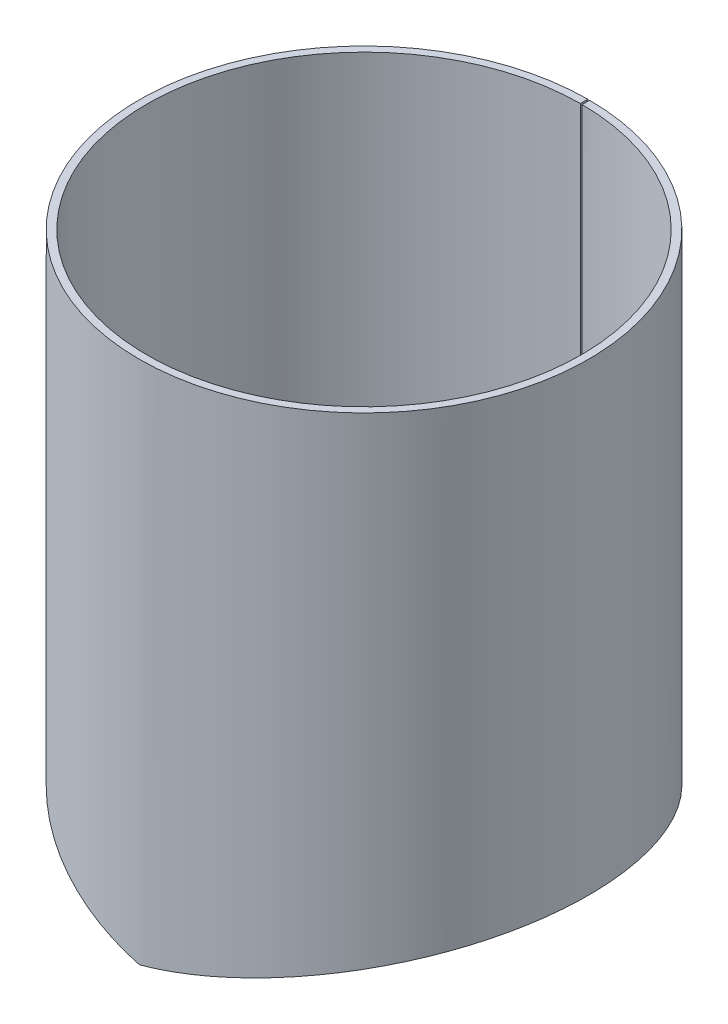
ISO-10303-21;
HEADER;
FILE_DESCRIPTION(('STEP AP214'),'2;1');
FILE_NAME('part.step','',(''),(''),'','','');
FILE_SCHEMA(('AUTOMOTIVE_DESIGN { 1 0 10303 214 1 1 1 1 }'));
ENDSEC;
DATA;
#1=APPLICATION_CONTEXT('core data for automotive mechanical design processes');
#2=APPLICATION_PROTOCOL_DEFINITION('international standard','automotive_design',2000,#1);
#3=PRODUCT_CONTEXT('',#1,'mechanical');
#4=PRODUCT('Part','Part','',(#3));
#5=PRODUCT_RELATED_PRODUCT_CATEGORY('part','',(#4));
#6=PRODUCT_DEFINITION_FORMATION('','',#4);
#7=PRODUCT_DEFINITION_CONTEXT('part definition',#1,'design');
#8=PRODUCT_DEFINITION('design','',#6,#7);
#9=PRODUCT_DEFINITION_SHAPE('','',#8);
#10=(LENGTH_UNIT() NAMED_UNIT(*) SI_UNIT(.MILLI.,.METRE.));
#11=(NAMED_UNIT(*) PLANE_ANGLE_UNIT() SI_UNIT($,.RADIAN.));
#12=(NAMED_UNIT(*) SI_UNIT($,.STERADIAN.) SOLID_ANGLE_UNIT());
#13=UNCERTAINTY_MEASURE_WITH_UNIT(LENGTH_MEASURE(1.E-05),#10,'distance_accuracy_value','');
#14=(GEOMETRIC_REPRESENTATION_CONTEXT(3) GLOBAL_UNCERTAINTY_ASSIGNED_CONTEXT((#13)) GLOBAL_UNIT_ASSIGNED_CONTEXT((#10,
#11,#12)) REPRESENTATION_CONTEXT('',''));
#15=CARTESIAN_POINT('',(0.,0.,0.));
#16=DIRECTION('',(0.,0.,1.));
#17=DIRECTION('',(1.,0.,0.));
#18=AXIS2_PLACEMENT_3D('',#15,#16,#17);
#19=CARTESIAN_POINT('',(-0.500000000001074,0.133974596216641,-119.998958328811));
#20=CARTESIAN_POINT('',(-3.69663056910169,0.990505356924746,-119.985638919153));
#21=CARTESIAN_POINT('',(-6.41378200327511,1.71827203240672,-119.849447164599));
#22=CARTESIAN_POINT('',(-9.76804071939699,2.61720451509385,-119.607031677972));
#23=CARTESIAN_POINT('',(-10.765993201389,2.8847052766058,-119.519337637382));
#24=CARTESIAN_POINT('',(-11.8638226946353,3.17890197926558,-119.412304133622));
#25=CARTESIAN_POINT('',(-12.0738510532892,3.23517894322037,-119.391233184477));
#26=CARTESIAN_POINT('',(-12.4932549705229,3.34755635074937,-119.348075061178));
#27=CARTESIAN_POINT('',(-12.701892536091,3.40345884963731,-119.326047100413));
#28=CARTESIAN_POINT('',(-13.3246084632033,3.57030773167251,-119.25866497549));
#29=CARTESIAN_POINT('',(-13.7354899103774,3.6803955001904,-119.212012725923));
#30=CARTESIAN_POINT('',(-17.3949902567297,4.66088204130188,-118.7777110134));
#31=CARTESIAN_POINT('',(-20.373954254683,5.45915718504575,-118.289914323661));
#32=CARTESIAN_POINT('',(-23.7560402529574,6.3654155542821,-117.627061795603));
#33=CARTESIAN_POINT('',(-24.4191700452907,6.54308840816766,-117.491102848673));
#34=CARTESIAN_POINT('',(-25.7386187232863,6.89657367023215,-117.209123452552));
#35=CARTESIAN_POINT('',(-26.3920170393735,7.07160668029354,-117.0636685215));
#36=CARTESIAN_POINT('',(-28.3331312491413,7.59157684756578,-116.614741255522));
#37=CARTESIAN_POINT('',(-29.6017589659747,7.93138514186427,-116.298711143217));
#38=CARTESIAN_POINT('',(-33.3307550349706,8.93029457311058,-115.306886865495));
#39=CARTESIAN_POINT('',(-35.7141354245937,9.56888025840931,-114.587440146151));
#40=CARTESIAN_POINT('',(-40.2754382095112,10.7913437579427,-113.064892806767));
#41=CARTESIAN_POINT('',(-42.453383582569,11.3752215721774,-112.261797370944));
#42=CARTESIAN_POINT('',(-45.5682899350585,12.2100073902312,-111.017031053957));
#43=CARTESIAN_POINT('',(-46.5809347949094,12.4813215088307,-110.595704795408));
#44=CARTESIAN_POINT('',(-48.586684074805,13.0186835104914,-109.729337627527));
#45=CARTESIAN_POINT('',(-49.575892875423,13.2836823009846,-109.285807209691));
#46=CARTESIAN_POINT('',(-54.4531943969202,14.5902652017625,-107.020365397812));
#47=CARTESIAN_POINT('',(-58.1344574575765,15.5766161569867,-105.055428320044));
#48=CARTESIAN_POINT('',(-63.3251220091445,16.9677695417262,-101.950936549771));
#49=CARTESIAN_POINT('',(-64.9981378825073,17.4161833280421,-100.89128075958));
#50=CARTESIAN_POINT('',(-68.2444343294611,18.2860421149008,-98.7243923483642));
#51=CARTESIAN_POINT('',(-69.8262473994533,18.7098123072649,-97.6112965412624));
#52=CARTESIAN_POINT('',(-74.4466142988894,19.9476452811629,-94.1933212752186));
#53=CARTESIAN_POINT('',(-77.3598840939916,20.7282304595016,-91.8098679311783));
#54=CARTESIAN_POINT('',(-82.8522307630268,22.2001272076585,-86.8856223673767));
#55=CARTESIAN_POINT('',(-85.4262123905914,22.8898805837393,-84.3512077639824));
#56=CARTESIAN_POINT('',(-90.2931156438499,24.1937653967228,-79.1196390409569));
#57=CARTESIAN_POINT('',(-92.5808117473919,24.806681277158,-76.4261789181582));
#58=CARTESIAN_POINT('',(-96.8638983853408,25.9544599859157,-70.9193395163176));
#59=CARTESIAN_POINT('',(-98.8565126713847,26.4885449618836,-68.1104267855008));
#60=CARTESIAN_POINT('',(-102.566669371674,27.4826063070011,-62.3836410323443));
#61=CARTESIAN_POINT('',(-104.285991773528,27.9431791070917,-59.4620486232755));
#62=CARTESIAN_POINT('',(-107.451683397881,28.7914089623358,-53.5297958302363));
#63=CARTESIAN_POINT('',(-108.898059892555,29.1790660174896,-50.5191427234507));
#64=CARTESIAN_POINT('',(-111.519022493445,29.8814643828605,-44.4351083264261));
#65=CARTESIAN_POINT('',(-112.696405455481,30.1968487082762,-41.3557676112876));
#66=CARTESIAN_POINT('',(-114.78909675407,30.7574753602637,-35.1317887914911));
#67=CARTESIAN_POINT('',(-115.703466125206,31.0024869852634,-31.9893066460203));
#68=CARTESIAN_POINT('',(-117.268313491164,31.4219068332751,-25.6661345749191));
#69=CARTESIAN_POINT('',(-117.918505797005,31.5961920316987,-22.488135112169));
#70=CARTESIAN_POINT('',(-119.480560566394,32.0146230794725,-12.8979288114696));
#71=CARTESIAN_POINT('',(-120.00052577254,32.1540343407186,-6.43599425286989));
#72=CARTESIAN_POINT('',(-119.999473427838,32.153771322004,6.45558554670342));
#73=CARTESIAN_POINT('',(-119.478587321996,32.0140817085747,12.916493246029));
#74=CARTESIAN_POINT('',(-117.914851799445,31.5952082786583,22.5073295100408));
#75=CARTESIAN_POINT('',(-117.264149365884,31.4208005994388,25.6851292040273));
#76=CARTESIAN_POINT('',(-115.698378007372,31.0011223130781,32.0076852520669));
#77=CARTESIAN_POINT('',(-114.783499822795,30.7559612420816,35.1501035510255));
#78=CARTESIAN_POINT('',(-112.689574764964,30.1949952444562,41.374404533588));
#79=CARTESIAN_POINT('',(-111.511139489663,29.8793456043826,44.4548679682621));
#80=CARTESIAN_POINT('',(-108.88931660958,29.1767435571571,50.5379683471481));
#81=CARTESIAN_POINT('',(-107.442350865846,28.7889157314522,53.5485672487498));
#82=CARTESIAN_POINT('',(-104.274958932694,27.9402064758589,59.4814320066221));
#83=CARTESIAN_POINT('',(-102.554525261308,27.4793250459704,62.4036905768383));
#84=CARTESIAN_POINT('',(-98.8414345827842,26.484508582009,68.1323862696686));
#85=CARTESIAN_POINT('',(-96.8481563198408,25.9502731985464,70.9408779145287));
#86=CARTESIAN_POINT('',(-92.5627478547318,24.8018658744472,76.4480951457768));
#87=CARTESIAN_POINT('',(-90.273568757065,24.1885375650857,79.1420202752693));
#88=CARTESIAN_POINT('',(-85.4028966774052,22.8836316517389,84.3748886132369));
#89=CARTESIAN_POINT('',(-82.8276041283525,22.1935397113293,86.9091122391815));
#90=CARTESIAN_POINT('',(-77.3333888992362,20.721124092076,91.8321989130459));
#91=CARTESIAN_POINT('',(-74.4186832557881,19.9401364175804,94.2154576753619));
#92=CARTESIAN_POINT('',(-69.7952515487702,18.7014851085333,97.6334782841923));
#93=CARTESIAN_POINT('',(-68.2122653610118,18.2774063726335,98.7466448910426));
#94=CARTESIAN_POINT('',(-64.9632978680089,17.4068589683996,100.913740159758));
#95=CARTESIAN_POINT('',(-63.2920593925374,16.9589340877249,101.971457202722));
#96=CARTESIAN_POINT('',(-58.1014689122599,15.5677888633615,105.073644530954));
#97=CARTESIAN_POINT('',(-54.4185210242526,14.5809458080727,107.038136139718));
#98=CARTESIAN_POINT('',(-49.536597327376,13.2731258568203,109.30363283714));
#99=CARTESIAN_POINT('',(-48.5463387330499,13.0078485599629,109.747204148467));
#100=CARTESIAN_POINT('',(-46.5382324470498,12.4698673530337,110.613691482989));
#101=CARTESIAN_POINT('',(-45.5238949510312,12.1981124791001,111.035224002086));
#102=CARTESIAN_POINT('',(-42.4138117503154,11.3646680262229,112.276678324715));
#103=CARTESIAN_POINT('',(-40.2371431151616,10.781121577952,113.078538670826));
#104=CARTESIAN_POINT('',(-33.3928158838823,8.94673179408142,115.36054014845));
#105=CARTESIAN_POINT('',(-28.4088856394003,7.61213801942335,116.718381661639));
#106=CARTESIAN_POINT('',(-20.3126081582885,5.44274647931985,118.300292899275));
#107=CARTESIAN_POINT('',(-17.3312952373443,4.64380086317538,118.787496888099));
#108=CARTESIAN_POINT('',(-13.2435213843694,3.54857273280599,119.269806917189));
#109=CARTESIAN_POINT('',(-12.4080589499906,3.32472934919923,119.359855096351));
#110=CARTESIAN_POINT('',(-10.7014583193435,2.86744706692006,119.524950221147));
#111=CARTESIAN_POINT('',(-9.70817626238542,2.60118600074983,119.612107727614));
#112=CARTESIAN_POINT('',(-6.2898248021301,1.68503155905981,119.856823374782));
#113=CARTESIAN_POINT('',(-3.43308275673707,0.919889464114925,120.000000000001));
#114=CARTESIAN_POINT('',(7.88389489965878E-13,5.82485316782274E-13,120.000000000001));
#115=CARTESIAN_POINT('',(-0.483333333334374,0.133974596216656,-115.998993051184));
#116=CARTESIAN_POINT('',(-3.5734079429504,0.990504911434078,-115.986117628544));
#117=CARTESIAN_POINT('',(-6.19998926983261,1.71827203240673,-115.854465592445));
#118=CARTESIAN_POINT('',(-9.44243936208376,2.61720451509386,-115.62013062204));
#119=CARTESIAN_POINT('',(-10.4071267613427,2.88470527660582,-115.535359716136));
#120=CARTESIAN_POINT('',(-11.4683619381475,3.1789019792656,-115.431893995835));
#121=CARTESIAN_POINT('',(-11.6713893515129,3.23517894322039,-115.411525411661));
#122=CARTESIAN_POINT('',(-12.0768131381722,3.34755635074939,-115.369805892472));
#123=CARTESIAN_POINT('',(-12.2784961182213,3.40345884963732,-115.348512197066));
#124=CARTESIAN_POINT('',(-12.8804548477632,3.57030773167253,-115.283376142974));
#125=CARTESIAN_POINT('',(-13.2776402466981,3.68039550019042,-115.238278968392));
#126=CARTESIAN_POINT('',(-16.8151572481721,4.6608820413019,-114.81845397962));
#127=CARTESIAN_POINT('',(-19.6948224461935,5.45915718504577,-114.346917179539));
#128=CARTESIAN_POINT('',(-22.9641722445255,6.36541555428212,-113.70615973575));
#129=CARTESIAN_POINT('',(-23.6051977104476,6.54308840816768,-113.574732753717));
#130=CARTESIAN_POINT('',(-24.8806647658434,6.89657367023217,-113.3021526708));
#131=CARTESIAN_POINT('',(-25.512283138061,7.07160668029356,-113.16154623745));
#132=CARTESIAN_POINT('',(-27.3886935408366,7.5915768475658,-112.727583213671));
#133=CARTESIAN_POINT('',(-28.6150336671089,7.93138514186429,-112.422087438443));
#134=CARTESIAN_POINT('',(-32.2197298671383,8.9302945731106,-111.463323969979));
#135=CARTESIAN_POINT('',(-34.5236642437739,9.56888025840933,-110.767858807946));
#136=CARTESIAN_POINT('',(-38.9329236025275,10.7913437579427,-109.296063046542));
#137=CARTESIAN_POINT('',(-41.0382707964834,11.3752215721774,-108.519737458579));
#138=CARTESIAN_POINT('',(-44.0493469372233,12.2100073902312,-107.316463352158));
#139=CARTESIAN_POINT('',(-45.0282369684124,12.4813215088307,-106.909181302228));
#140=CARTESIAN_POINT('',(-46.9671279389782,13.0186835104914,-106.071693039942));
#141=CARTESIAN_POINT('',(-47.9233631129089,13.2836823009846,-105.642946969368));
#142=CARTESIAN_POINT('',(-52.6380879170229,14.5902652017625,-103.453019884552));
#143=CARTESIAN_POINT('',(-56.1966422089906,15.5766161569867,-101.553580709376));
#144=CARTESIAN_POINT('',(-61.2142846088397,16.9677695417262,-98.5525719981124));
#145=CARTESIAN_POINT('',(-62.8315332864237,17.4161833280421,-97.5282380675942));
#146=CARTESIAN_POINT('',(-65.9696198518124,18.2860421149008,-95.4335792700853));
#147=CARTESIAN_POINT('',(-67.4987058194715,18.7098123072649,-94.3575866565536));
#148=CARTESIAN_POINT('',(-71.9650604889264,19.9476452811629,-91.053543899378));
#149=CARTESIAN_POINT('',(-74.7812212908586,20.7282304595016,-88.749539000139));
#150=CARTESIAN_POINT('',(-80.0904897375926,22.2001272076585,-83.9894349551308));
#151=CARTESIAN_POINT('',(-82.5786719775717,22.8898805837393,-81.5395008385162));
#152=CARTESIAN_POINT('',(-87.2833451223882,24.1937653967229,-76.4823177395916));
#153=CARTESIAN_POINT('',(-89.4947846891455,24.8066812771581,-73.8786396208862));
#154=CARTESIAN_POINT('',(-93.6351017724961,25.9544599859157,-68.5553615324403));
#155=CARTESIAN_POINT('',(-95.5612955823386,26.4885449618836,-65.8400792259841));
#156=CARTESIAN_POINT('',(-99.1477803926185,27.4826063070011,-60.3041863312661));
#157=CARTESIAN_POINT('',(-100.809792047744,27.9431791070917,-57.479980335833));
#158=CARTESIAN_POINT('',(-103.869960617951,28.7914089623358,-51.7454693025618));
#159=CARTESIAN_POINT('',(-105.268124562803,29.1790660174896,-48.8351712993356));
#160=CARTESIAN_POINT('',(-107.801721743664,29.8814643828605,-42.9539380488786));
#161=CARTESIAN_POINT('',(-108.939858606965,30.1968487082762,-39.9772420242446));
#162=CARTESIAN_POINT('',(-110.962793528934,30.7574753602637,-33.9607291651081));
#163=CARTESIAN_POINT('',(-111.846683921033,31.0024869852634,-30.9229964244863));
#164=CARTESIAN_POINT('',(-113.359369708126,31.4219068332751,-24.8105967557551));
#165=CARTESIAN_POINT('',(-113.987888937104,31.5961920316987,-21.73853060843));
#166=CARTESIAN_POINT('',(-115.497875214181,32.0146230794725,-12.4679978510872));
#167=CARTESIAN_POINT('',(-116.000508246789,32.1540343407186,-6.22146111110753));
#168=CARTESIAN_POINT('',(-115.999490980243,32.153771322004,6.24039936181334));
#169=CARTESIAN_POINT('',(-115.495967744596,32.0140817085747,12.4859434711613));
#170=CARTESIAN_POINT('',(-113.984356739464,31.5952082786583,21.7570851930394));
#171=CARTESIAN_POINT('',(-113.355344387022,31.4208005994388,24.8289582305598));
#172=CARTESIAN_POINT('',(-111.841765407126,31.001122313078,30.9407624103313));
#173=CARTESIAN_POINT('',(-110.957383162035,30.7559612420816,33.978433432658));
#174=CARTESIAN_POINT('',(-108.933255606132,30.1949952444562,39.9952577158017));
#175=CARTESIAN_POINT('',(-107.794101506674,29.8793456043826,42.9730390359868));
#176=CARTESIAN_POINT('',(-105.259672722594,29.1767435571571,48.8533694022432));
#177=CARTESIAN_POINT('',(-103.860939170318,28.7889157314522,51.7636150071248));
#178=CARTESIAN_POINT('',(-100.799126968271,27.9402064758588,57.4987176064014));
#179=CARTESIAN_POINT('',(-99.1360410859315,27.4793250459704,60.3235675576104));
#180=CARTESIAN_POINT('',(-95.5467200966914,26.484508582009,65.8613067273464));
#181=CARTESIAN_POINT('',(-93.6198844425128,25.9502731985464,68.5761819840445));
#182=CARTESIAN_POINT('',(-89.4773229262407,24.8018658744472,73.8998253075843));
#183=CARTESIAN_POINT('',(-87.2644497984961,24.1885375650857,76.5039529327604));
#184=CARTESIAN_POINT('',(-82.556133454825,22.8836316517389,81.5623923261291));
#185=CARTESIAN_POINT('',(-80.0666839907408,22.1935397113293,84.0121418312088));
#186=CARTESIAN_POINT('',(-74.7556092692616,20.721124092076,88.7711256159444));
#187=CARTESIAN_POINT('',(-71.9380604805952,19.9401364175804,91.0749424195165));
#188=CARTESIAN_POINT('',(-67.4687431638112,18.7014851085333,94.3790290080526));
#189=CARTESIAN_POINT('',(-65.9385231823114,18.2774063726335,95.4550900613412));
#190=CARTESIAN_POINT('',(-62.7978546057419,17.4068589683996,97.5499488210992));
#191=CARTESIAN_POINT('',(-61.1823240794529,16.9589340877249,98.5724086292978));
#192=CARTESIAN_POINT('',(-56.1647532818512,15.5677888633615,101.571189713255));
#193=CARTESIAN_POINT('',(-52.6045703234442,14.5809458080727,103.470198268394));
#194=CARTESIAN_POINT('',(-47.8853774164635,13.2731258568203,105.660178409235));
#195=CARTESIAN_POINT('',(-46.9281274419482,13.0078485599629,106.088964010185));
#196=CARTESIAN_POINT('',(-44.9869580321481,12.4698673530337,106.926568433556));
#197=CARTESIAN_POINT('',(-44.0064317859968,12.1981124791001,107.334049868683));
#198=CARTESIAN_POINT('',(-41.0000180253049,11.3646680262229,108.534122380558));
#199=CARTESIAN_POINT('',(-38.8959050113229,10.781121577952,109.309254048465));
#200=CARTESIAN_POINT('',(-32.2797220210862,8.94673179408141,111.515188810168));
#201=CARTESIAN_POINT('',(-27.4619227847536,7.61213801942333,112.827768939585));
#202=CARTESIAN_POINT('',(-19.6355212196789,5.44274647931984,114.356949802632));
#203=CARTESIAN_POINT('',(-16.7535853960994,4.64380086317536,114.827913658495));
#204=CARTESIAN_POINT('',(-12.8020706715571,3.54857273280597,115.294146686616));
#205=CARTESIAN_POINT('',(-11.9944569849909,3.32472934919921,115.381193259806));
#206=CARTESIAN_POINT('',(-10.344743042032,2.86744706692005,115.540785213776));
#207=CARTESIAN_POINT('',(-9.38457038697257,2.60118600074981,115.625037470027));
#208=CARTESIAN_POINT('',(-6.08016397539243,1.68503155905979,115.861595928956));
#209=CARTESIAN_POINT('',(-3.31864455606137,0.919888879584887,116.000000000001));
#210=CARTESIAN_POINT('',(7.59477921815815E-13,5.67171895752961E-13,116.000000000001));
#211=B_SPLINE_SURFACE_WITH_KNOTS('',1,3,((#19,#20,#21,#22,#23,#24,#25,#26,#27,#28,#29,#30,#31,
#32,#33,#34,#35,#36,#37,#38,#39,#40,#41,#42,#43,#44,#45,#46,#47,#48,#49,#50,#51,#52,#53,#54,#55,
#56,#57,#58,#59,#60,#61,#62,#63,#64,#65,#66,#67,#68,#69,#70,#71,#72,#73,#74,#75,#76,#77,#78,#79,
#80,#81,#82,#83,#84,#85,#86,#87,#88,#89,#90,#91,#92,#93,#94,#95,#96,#97,#98,#99,#100,#101,#102,
#103,#104,#105,#106,#107,#108,#109,#110,#111,#112,#113,#114),(#115,#116,#117,#118,#119,#120,
#121,#122,#123,#124,#125,#126,#127,#128,#129,#130,#131,#132,#133,#134,#135,#136,#137,#138,#139,
#140,#141,#142,#143,#144,#145,#146,#147,#148,#149,#150,#151,#152,#153,#154,#155,#156,#157,#158,
#159,#160,#161,#162,#163,#164,#165,#166,#167,#168,#169,#170,#171,#172,#173,#174,#175,#176,#177,
#178,#179,#180,#181,#182,#183,#184,#185,#186,#187,#188,#189,#190,#191,#192,#193,#194,#195,#196,
#197,#198,#199,#200,#201,#202,#203,#204,#205,#206,#207,#208,#209,#210)),.UNSPECIFIED.,.F.,.F.,
.F.,(2,2),(4,2,2,2,2,2,2,2,2,2,2,2,2,2,2,2,2,2,2,2,2,2,2,2,2,2,2,2,2,2,2,2,2,2,2,2,2,2,2,2,2,2,
2,2,2,2,2,4),(0.,1.),(0.,0.0078125,0.01171875,0.0126953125,0.013671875,0.015625,0.03125,
0.03515625,0.0390625,0.046875,0.0625,0.078125,0.0859375,0.09375,0.125,0.140625,0.15625,0.1875,
0.21875,0.25,0.28125,0.3125,0.34375,0.375,0.40625,0.4375,0.5,0.5625,0.59375,0.625,0.65625,
0.6875,0.71875,0.75,0.78125,0.8125,0.84375,0.859375,0.875,0.90625,0.9140625,0.921875,0.9375,
0.96875,0.984375,0.98828125,0.9921875,1.),.UNSPECIFIED.);
#212=CARTESIAN_POINT('',(-0.500000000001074,0.133974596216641,-119.998958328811));
#213=CARTESIAN_POINT('',(-0.483333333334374,0.133974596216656,-115.998993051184));
#214=B_SPLINE_CURVE_WITH_KNOTS('',1,(#212,#213),.UNSPECIFIED.,.F.,.F.,(2,2),(0.,1.),.UNSPECIFIED.);
#215=CARTESIAN_POINT('',(-0.483333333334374,0.133974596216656,-115.998993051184));
#216=VERTEX_POINT('',#215);
#217=CARTESIAN_POINT('',(-0.500000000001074,0.133974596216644,-119.998958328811));
#218=VERTEX_POINT('',#217);
#219=EDGE_CURVE('E13',#216,#218,#214,.F.);
#220=CARTESIAN_POINT('',(-0.483333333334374,0.133974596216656,-115.998993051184));
#221=CARTESIAN_POINT('',(-3.5734079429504,0.990504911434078,-115.986117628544));
#222=CARTESIAN_POINT('',(-6.19998926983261,1.71827203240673,-115.854465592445));
#223=CARTESIAN_POINT('',(-9.44243936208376,2.61720451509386,-115.62013062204));
#224=CARTESIAN_POINT('',(-10.4071267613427,2.88470527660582,-115.535359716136));
#225=CARTESIAN_POINT('',(-11.4683619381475,3.1789019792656,-115.431893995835));
#226=CARTESIAN_POINT('',(-11.6713893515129,3.23517894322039,-115.411525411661));
#227=CARTESIAN_POINT('',(-12.0768131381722,3.34755635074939,-115.369805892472));
#228=CARTESIAN_POINT('',(-12.2784961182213,3.40345884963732,-115.348512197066));
#229=CARTESIAN_POINT('',(-12.8804548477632,3.57030773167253,-115.283376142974));
#230=CARTESIAN_POINT('',(-13.2776402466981,3.68039550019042,-115.238278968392));
#231=CARTESIAN_POINT('',(-16.8151572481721,4.6608820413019,-114.81845397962));
#232=CARTESIAN_POINT('',(-19.6948224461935,5.45915718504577,-114.346917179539));
#233=CARTESIAN_POINT('',(-22.9641722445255,6.36541555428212,-113.70615973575));
#234=CARTESIAN_POINT('',(-23.6051977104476,6.54308840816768,-113.574732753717));
#235=CARTESIAN_POINT('',(-24.8806647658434,6.89657367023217,-113.3021526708));
#236=CARTESIAN_POINT('',(-25.512283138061,7.07160668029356,-113.16154623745));
#237=CARTESIAN_POINT('',(-27.3886935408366,7.5915768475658,-112.727583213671));
#238=CARTESIAN_POINT('',(-28.6150336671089,7.93138514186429,-112.422087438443));
#239=CARTESIAN_POINT('',(-32.2197298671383,8.9302945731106,-111.463323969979));
#240=CARTESIAN_POINT('',(-34.5236642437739,9.56888025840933,-110.767858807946));
#241=CARTESIAN_POINT('',(-38.9329236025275,10.7913437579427,-109.296063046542));
#242=CARTESIAN_POINT('',(-41.0382707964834,11.3752215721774,-108.519737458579));
#243=CARTESIAN_POINT('',(-44.0493469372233,12.2100073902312,-107.316463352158));
#244=CARTESIAN_POINT('',(-45.0282369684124,12.4813215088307,-106.909181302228));
#245=CARTESIAN_POINT('',(-46.9671279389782,13.0186835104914,-106.071693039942));
#246=CARTESIAN_POINT('',(-47.9233631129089,13.2836823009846,-105.642946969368));
#247=CARTESIAN_POINT('',(-52.6380879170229,14.5902652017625,-103.453019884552));
#248=CARTESIAN_POINT('',(-56.1966422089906,15.5766161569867,-101.553580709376));
#249=CARTESIAN_POINT('',(-61.2142846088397,16.9677695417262,-98.5525719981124));
#250=CARTESIAN_POINT('',(-62.8315332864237,17.4161833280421,-97.5282380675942));
#251=CARTESIAN_POINT('',(-65.9696198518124,18.2860421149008,-95.4335792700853));
#252=CARTESIAN_POINT('',(-67.4987058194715,18.7098123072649,-94.3575866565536));
#253=CARTESIAN_POINT('',(-71.9650604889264,19.9476452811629,-91.053543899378));
#254=CARTESIAN_POINT('',(-74.7812212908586,20.7282304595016,-88.749539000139));
#255=CARTESIAN_POINT('',(-80.0904897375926,22.2001272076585,-83.9894349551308));
#256=CARTESIAN_POINT('',(-82.5786719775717,22.8898805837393,-81.5395008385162));
#257=CARTESIAN_POINT('',(-87.2833451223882,24.1937653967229,-76.4823177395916));
#258=CARTESIAN_POINT('',(-89.4947846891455,24.8066812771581,-73.8786396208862));
#259=CARTESIAN_POINT('',(-93.6351017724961,25.9544599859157,-68.5553615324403));
#260=CARTESIAN_POINT('',(-95.5612955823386,26.4885449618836,-65.8400792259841));
#261=CARTESIAN_POINT('',(-99.1477803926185,27.4826063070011,-60.3041863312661));
#262=CARTESIAN_POINT('',(-100.809792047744,27.9431791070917,-57.479980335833));
#263=CARTESIAN_POINT('',(-103.869960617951,28.7914089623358,-51.7454693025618));
#264=CARTESIAN_POINT('',(-105.268124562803,29.1790660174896,-48.8351712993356));
#265=CARTESIAN_POINT('',(-107.801721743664,29.8814643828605,-42.9539380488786));
#266=CARTESIAN_POINT('',(-108.939858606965,30.1968487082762,-39.9772420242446));
#267=CARTESIAN_POINT('',(-110.962793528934,30.7574753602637,-33.9607291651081));
#268=CARTESIAN_POINT('',(-111.846683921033,31.0024869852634,-30.9229964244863));
#269=CARTESIAN_POINT('',(-113.359369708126,31.4219068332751,-24.8105967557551));
#270=CARTESIAN_POINT('',(-113.987888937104,31.5961920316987,-21.73853060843));
#271=CARTESIAN_POINT('',(-115.497875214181,32.0146230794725,-12.4679978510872));
#272=CARTESIAN_POINT('',(-116.000508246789,32.1540343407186,-6.22146111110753));
#273=CARTESIAN_POINT('',(-115.999490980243,32.153771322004,6.24039936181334));
#274=CARTESIAN_POINT('',(-115.495967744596,32.0140817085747,12.4859434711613));
#275=CARTESIAN_POINT('',(-113.984356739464,31.5952082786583,21.7570851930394));
#276=CARTESIAN_POINT('',(-113.355344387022,31.4208005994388,24.8289582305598));
#277=CARTESIAN_POINT('',(-111.841765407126,31.001122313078,30.9407624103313));
#278=CARTESIAN_POINT('',(-110.957383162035,30.7559612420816,33.978433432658));
#279=CARTESIAN_POINT('',(-108.933255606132,30.1949952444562,39.9952577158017));
#280=CARTESIAN_POINT('',(-107.794101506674,29.8793456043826,42.9730390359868));
#281=CARTESIAN_POINT('',(-105.259672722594,29.1767435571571,48.8533694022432));
#282=CARTESIAN_POINT('',(-103.860939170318,28.7889157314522,51.7636150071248));
#283=CARTESIAN_POINT('',(-100.799126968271,27.9402064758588,57.4987176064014));
#284=CARTESIAN_POINT('',(-99.1360410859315,27.4793250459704,60.3235675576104));
#285=CARTESIAN_POINT('',(-95.5467200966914,26.484508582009,65.8613067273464));
#286=CARTESIAN_POINT('',(-93.6198844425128,25.9502731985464,68.5761819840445));
#287=CARTESIAN_POINT('',(-89.4773229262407,24.8018658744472,73.8998253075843));
#288=CARTESIAN_POINT('',(-87.2644497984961,24.1885375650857,76.5039529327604));
#289=CARTESIAN_POINT('',(-82.556133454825,22.8836316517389,81.5623923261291));
#290=CARTESIAN_POINT('',(-80.0666839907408,22.1935397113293,84.0121418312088));
#291=CARTESIAN_POINT('',(-74.7556092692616,20.721124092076,88.7711256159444));
#292=CARTESIAN_POINT('',(-71.9380604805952,19.9401364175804,91.0749424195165));
#293=CARTESIAN_POINT('',(-67.4687431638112,18.7014851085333,94.3790290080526));
#294=CARTESIAN_POINT('',(-65.9385231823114,18.2774063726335,95.4550900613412));
#295=CARTESIAN_POINT('',(-62.7978546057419,17.4068589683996,97.5499488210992));
#296=CARTESIAN_POINT('',(-61.1823240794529,16.9589340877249,98.5724086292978));
#297=CARTESIAN_POINT('',(-56.1647532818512,15.5677888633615,101.571189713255));
#298=CARTESIAN_POINT('',(-52.6045703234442,14.5809458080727,103.470198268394));
#299=CARTESIAN_POINT('',(-47.8853774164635,13.2731258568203,105.660178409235));
#300=CARTESIAN_POINT('',(-46.9281274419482,13.0078485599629,106.088964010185));
#301=CARTESIAN_POINT('',(-44.9869580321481,12.4698673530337,106.926568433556));
#302=CARTESIAN_POINT('',(-44.0064317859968,12.1981124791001,107.334049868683));
#303=CARTESIAN_POINT('',(-41.0000180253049,11.3646680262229,108.534122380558));
#304=CARTESIAN_POINT('',(-38.8959050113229,10.781121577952,109.309254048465));
#305=CARTESIAN_POINT('',(-32.2797220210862,8.94673179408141,111.515188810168));
#306=CARTESIAN_POINT('',(-27.4619227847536,7.61213801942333,112.827768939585));
#307=CARTESIAN_POINT('',(-19.6355212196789,5.44274647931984,114.356949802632));
#308=CARTESIAN_POINT('',(-16.7535853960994,4.64380086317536,114.827913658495));
#309=CARTESIAN_POINT('',(-12.8020706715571,3.54857273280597,115.294146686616));
#310=CARTESIAN_POINT('',(-11.9944569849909,3.32472934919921,115.381193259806));
#311=CARTESIAN_POINT('',(-10.344743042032,2.86744706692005,115.540785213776));
#312=CARTESIAN_POINT('',(-9.38457038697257,2.60118600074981,115.625037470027));
#313=CARTESIAN_POINT('',(-6.08016397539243,1.68503155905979,115.861595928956));
#314=CARTESIAN_POINT('',(-3.31864455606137,0.919888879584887,116.000000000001));
#315=CARTESIAN_POINT('',(7.59477921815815E-13,5.67171895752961E-13,116.000000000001));
#316=B_SPLINE_CURVE_WITH_KNOTS('',3,(#220,#221,#222,#223,#224,#225,#226,#227,#228,#229,#230,
#231,#232,#233,#234,#235,#236,#237,#238,#239,#240,#241,#242,#243,#244,#245,#246,#247,#248,#249,
#250,#251,#252,#253,#254,#255,#256,#257,#258,#259,#260,#261,#262,#263,#264,#265,#266,#267,#268,
#269,#270,#271,#272,#273,#274,#275,#276,#277,#278,#279,#280,#281,#282,#283,#284,#285,#286,#287,
#288,#289,#290,#291,#292,#293,#294,#295,#296,#297,#298,#299,#300,#301,#302,#303,#304,#305,#306,
#307,#308,#309,#310,#311,#312,#313,#314,#315),.UNSPECIFIED.,.F.,.F.,(4,2,2,2,2,2,2,2,2,2,2,2,2,
2,2,2,2,2,2,2,2,2,2,2,2,2,2,2,2,2,2,2,2,2,2,2,2,2,2,2,2,2,2,2,2,2,2,4),(0.,0.0078125,0.01171875,
0.0126953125,0.013671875,0.015625,0.03125,0.03515625,0.0390625,0.046875,0.0625,0.078125,
0.0859375,0.09375,0.125,0.140625,0.15625,0.1875,0.21875,0.25,0.28125,0.3125,0.34375,0.375,
0.40625,0.4375,0.5,0.5625,0.59375,0.625,0.65625,0.6875,0.71875,0.75,0.78125,0.8125,0.84375,
0.859375,0.875,0.90625,0.9140625,0.921875,0.9375,0.96875,0.984375,0.98828125,0.9921875,1.),.UNSPECIFIED.);
#317=CARTESIAN_POINT('',(7.59477921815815E-13,5.67171895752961E-13,116.000000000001));
#318=VERTEX_POINT('',#317);
#319=EDGE_CURVE('E86',#216,#318,#316,.T.);
#320=CARTESIAN_POINT('',(7.59477921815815E-13,5.67171895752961E-13,116.000000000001));
#321=CARTESIAN_POINT('',(7.88389489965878E-13,5.82485316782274E-13,120.000000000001));
#322=B_SPLINE_CURVE_WITH_KNOTS('',1,(#320,#321),.UNSPECIFIED.,.F.,.F.,(2,2),(0.,1.),.UNSPECIFIED.);
#323=CARTESIAN_POINT('',(-9.33496331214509E-07,2.50129829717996E-07,120.000000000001));
#324=VERTEX_POINT('',#323);
#325=EDGE_CURVE('E49',#318,#324,#322,.T.);
#326=CARTESIAN_POINT('',(7.88389489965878E-13,5.82485316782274E-13,120.000000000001));
#327=CARTESIAN_POINT('',(-3.43308275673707,0.919889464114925,120.000000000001));
#328=CARTESIAN_POINT('',(-6.2898248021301,1.68503155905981,119.856823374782));
#329=CARTESIAN_POINT('',(-9.70817626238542,2.60118600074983,119.612107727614));
#330=CARTESIAN_POINT('',(-10.7014583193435,2.86744706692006,119.524950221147));
#331=CARTESIAN_POINT('',(-12.4080589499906,3.32472934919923,119.359855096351));
#332=CARTESIAN_POINT('',(-13.2435213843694,3.54857273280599,119.269806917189));
#333=CARTESIAN_POINT('',(-17.3312952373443,4.64380086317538,118.787496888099));
#334=CARTESIAN_POINT('',(-20.3126081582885,5.44274647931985,118.300292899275));
#335=CARTESIAN_POINT('',(-28.4088856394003,7.61213801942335,116.718381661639));
#336=CARTESIAN_POINT('',(-33.3928158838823,8.94673179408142,115.36054014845));
#337=CARTESIAN_POINT('',(-40.2371431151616,10.781121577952,113.078538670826));
#338=CARTESIAN_POINT('',(-42.4138117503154,11.3646680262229,112.276678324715));
#339=CARTESIAN_POINT('',(-45.5238949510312,12.1981124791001,111.035224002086));
#340=CARTESIAN_POINT('',(-46.5382324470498,12.4698673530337,110.613691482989));
#341=CARTESIAN_POINT('',(-48.5463387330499,13.0078485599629,109.747204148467));
#342=CARTESIAN_POINT('',(-49.536597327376,13.2731258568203,109.30363283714));
#343=CARTESIAN_POINT('',(-54.4185210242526,14.5809458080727,107.038136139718));
#344=CARTESIAN_POINT('',(-58.1014689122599,15.5677888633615,105.073644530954));
#345=CARTESIAN_POINT('',(-63.2920593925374,16.9589340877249,101.971457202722));
#346=CARTESIAN_POINT('',(-64.9632978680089,17.4068589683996,100.913740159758));
#347=CARTESIAN_POINT('',(-68.2122653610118,18.2774063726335,98.7466448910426));
#348=CARTESIAN_POINT('',(-69.7952515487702,18.7014851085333,97.6334782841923));
#349=CARTESIAN_POINT('',(-74.4186832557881,19.9401364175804,94.2154576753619));
#350=CARTESIAN_POINT('',(-77.3333888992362,20.721124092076,91.8321989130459));
#351=CARTESIAN_POINT('',(-82.8276041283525,22.1935397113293,86.9091122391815));
#352=CARTESIAN_POINT('',(-85.4028966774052,22.8836316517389,84.3748886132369));
#353=CARTESIAN_POINT('',(-90.273568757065,24.1885375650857,79.1420202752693));
#354=CARTESIAN_POINT('',(-92.5627478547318,24.8018658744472,76.4480951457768));
#355=CARTESIAN_POINT('',(-96.8481563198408,25.9502731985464,70.9408779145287));
#356=CARTESIAN_POINT('',(-98.8414345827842,26.484508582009,68.1323862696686));
#357=CARTESIAN_POINT('',(-102.554525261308,27.4793250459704,62.4036905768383));
#358=CARTESIAN_POINT('',(-104.274958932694,27.9402064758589,59.4814320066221));
#359=CARTESIAN_POINT('',(-107.442350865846,28.7889157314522,53.5485672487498));
#360=CARTESIAN_POINT('',(-108.88931660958,29.1767435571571,50.5379683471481));
#361=CARTESIAN_POINT('',(-111.511139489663,29.8793456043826,44.4548679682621));
#362=CARTESIAN_POINT('',(-112.689574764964,30.1949952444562,41.374404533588));
#363=CARTESIAN_POINT('',(-114.783499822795,30.7559612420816,35.1501035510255));
#364=CARTESIAN_POINT('',(-115.698378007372,31.0011223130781,32.0076852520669));
#365=CARTESIAN_POINT('',(-117.264149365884,31.4208005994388,25.6851292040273));
#366=CARTESIAN_POINT('',(-117.914851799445,31.5952082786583,22.5073295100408));
#367=CARTESIAN_POINT('',(-119.478587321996,32.0140817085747,12.916493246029));
#368=CARTESIAN_POINT('',(-119.999473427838,32.153771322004,6.45558554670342));
#369=CARTESIAN_POINT('',(-120.00052577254,32.1540343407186,-6.43599425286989));
#370=CARTESIAN_POINT('',(-119.480560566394,32.0146230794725,-12.8979288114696));
#371=CARTESIAN_POINT('',(-117.918505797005,31.5961920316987,-22.488135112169));
#372=CARTESIAN_POINT('',(-117.268313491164,31.4219068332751,-25.6661345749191));
#373=CARTESIAN_POINT('',(-115.703466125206,31.0024869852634,-31.9893066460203));
#374=CARTESIAN_POINT('',(-114.78909675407,30.7574753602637,-35.1317887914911));
#375=CARTESIAN_POINT('',(-112.696405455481,30.1968487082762,-41.3557676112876));
#376=CARTESIAN_POINT('',(-111.519022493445,29.8814643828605,-44.4351083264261));
#377=CARTESIAN_POINT('',(-108.898059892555,29.1790660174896,-50.5191427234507));
#378=CARTESIAN_POINT('',(-107.451683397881,28.7914089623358,-53.5297958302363));
#379=CARTESIAN_POINT('',(-104.285991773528,27.9431791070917,-59.4620486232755));
#380=CARTESIAN_POINT('',(-102.566669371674,27.4826063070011,-62.3836410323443));
#381=CARTESIAN_POINT('',(-98.8565126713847,26.4885449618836,-68.1104267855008));
#382=CARTESIAN_POINT('',(-96.8638983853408,25.9544599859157,-70.9193395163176));
#383=CARTESIAN_POINT('',(-92.5808117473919,24.806681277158,-76.4261789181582));
#384=CARTESIAN_POINT('',(-90.2931156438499,24.1937653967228,-79.1196390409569));
#385=CARTESIAN_POINT('',(-85.4262123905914,22.8898805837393,-84.3512077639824));
#386=CARTESIAN_POINT('',(-82.8522307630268,22.2001272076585,-86.8856223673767));
#387=CARTESIAN_POINT('',(-77.3598840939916,20.7282304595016,-91.8098679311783));
#388=CARTESIAN_POINT('',(-74.4466142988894,19.9476452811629,-94.1933212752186));
#389=CARTESIAN_POINT('',(-69.8262473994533,18.7098123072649,-97.6112965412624));
#390=CARTESIAN_POINT('',(-68.2444343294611,18.2860421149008,-98.7243923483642));
#391=CARTESIAN_POINT('',(-64.9981378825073,17.4161833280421,-100.89128075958));
#392=CARTESIAN_POINT('',(-63.3251220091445,16.9677695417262,-101.950936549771));
#393=CARTESIAN_POINT('',(-58.1344574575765,15.5766161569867,-105.055428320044));
#394=CARTESIAN_POINT('',(-54.4531943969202,14.5902652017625,-107.020365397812));
#395=CARTESIAN_POINT('',(-49.575892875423,13.2836823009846,-109.285807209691));
#396=CARTESIAN_POINT('',(-48.586684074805,13.0186835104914,-109.729337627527));
#397=CARTESIAN_POINT('',(-46.5809347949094,12.4813215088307,-110.595704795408));
#398=CARTESIAN_POINT('',(-45.5682899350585,12.2100073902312,-111.017031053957));
#399=CARTESIAN_POINT('',(-42.453383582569,11.3752215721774,-112.261797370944));
#400=CARTESIAN_POINT('',(-40.2754382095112,10.7913437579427,-113.064892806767));
#401=CARTESIAN_POINT('',(-35.7141354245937,9.56888025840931,-114.587440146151));
#402=CARTESIAN_POINT('',(-33.3307550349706,8.93029457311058,-115.306886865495));
#403=CARTESIAN_POINT('',(-29.6017589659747,7.93138514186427,-116.298711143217));
#404=CARTESIAN_POINT('',(-28.3331312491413,7.59157684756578,-116.614741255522));
#405=CARTESIAN_POINT('',(-26.3920170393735,7.07160668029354,-117.0636685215));
#406=CARTESIAN_POINT('',(-25.7386187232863,6.89657367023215,-117.209123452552));
#407=CARTESIAN_POINT('',(-24.4191700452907,6.54308840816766,-117.491102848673));
#408=CARTESIAN_POINT('',(-23.7560402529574,6.3654155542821,-117.627061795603));
#409=CARTESIAN_POINT('',(-20.373954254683,5.45915718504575,-118.289914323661));
#410=CARTESIAN_POINT('',(-17.3949902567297,4.66088204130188,-118.7777110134));
#411=CARTESIAN_POINT('',(-13.7354899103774,3.6803955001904,-119.212012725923));
#412=CARTESIAN_POINT('',(-13.3246084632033,3.57030773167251,-119.25866497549));
#413=CARTESIAN_POINT('',(-12.701892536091,3.40345884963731,-119.326047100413));
#414=CARTESIAN_POINT('',(-12.4932549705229,3.34755635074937,-119.348075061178));
#415=CARTESIAN_POINT('',(-12.0738510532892,3.23517894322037,-119.391233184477));
#416=CARTESIAN_POINT('',(-11.8638226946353,3.17890197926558,-119.412304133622));
#417=CARTESIAN_POINT('',(-10.765993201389,2.8847052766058,-119.519337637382));
#418=CARTESIAN_POINT('',(-9.76804071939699,2.61720451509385,-119.607031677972));
#419=CARTESIAN_POINT('',(-6.41378200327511,1.71827203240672,-119.849447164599));
#420=CARTESIAN_POINT('',(-3.69663056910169,0.990505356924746,-119.985638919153));
#421=CARTESIAN_POINT('',(-0.500000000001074,0.133974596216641,-119.998958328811));
#422=B_SPLINE_CURVE_WITH_KNOTS('',3,(#326,#327,#328,#329,#330,#331,#332,#333,#334,#335,#336,
#337,#338,#339,#340,#341,#342,#343,#344,#345,#346,#347,#348,#349,#350,#351,#352,#353,#354,#355,
#356,#357,#358,#359,#360,#361,#362,#363,#364,#365,#366,#367,#368,#369,#370,#371,#372,#373,#374,
#375,#376,#377,#378,#379,#380,#381,#382,#383,#384,#385,#386,#387,#388,#389,#390,#391,#392,#393,
#394,#395,#396,#397,#398,#399,#400,#401,#402,#403,#404,#405,#406,#407,#408,#409,#410,#411,#412,
#413,#414,#415,#416,#417,#418,#419,#420,#421),.UNSPECIFIED.,.F.,.F.,(4,2,2,2,2,2,2,2,2,2,2,2,2,
2,2,2,2,2,2,2,2,2,2,2,2,2,2,2,2,2,2,2,2,2,2,2,2,2,2,2,2,2,2,2,2,2,2,4),(0.,0.0078125,0.01171875,
0.015625,0.03125,0.0625,0.078125,0.0859375,0.09375,0.125,0.140625,0.15625,0.1875,0.21875,0.25,
0.28125,0.3125,0.34375,0.375,0.40625,0.4375,0.5,0.5625,0.59375,0.625,0.65625,0.6875,0.71875,
0.75,0.78125,0.8125,0.84375,0.859375,0.875,0.90625,0.9140625,0.921875,0.9375,0.953125,0.9609375,
0.96484375,0.96875,0.984375,0.986328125,0.9873046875,0.98828125,0.9921875,1.),.UNSPECIFIED.);
#423=EDGE_CURVE('E89',#218,#324,#422,.F.);
#424=ORIENTED_EDGE('',*,*,#219,.F.);
#425=ORIENTED_EDGE('',*,*,#319,.T.);
#426=ORIENTED_EDGE('',*,*,#325,.T.);
#427=ORIENTED_EDGE('',*,*,#423,.F.);
#428=EDGE_LOOP('',(#424,#425,#426,#427));
#429=FACE_BOUND('',#428,.T.);
#430=ADVANCED_FACE('F38',(#429),#211,.T.);
#431=CARTESIAN_POINT('',(0.499999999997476,0.133974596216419,-119.998958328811));
#432=CARTESIAN_POINT('',(3.69662514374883,0.990503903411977,-119.985638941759));
#433=CARTESIAN_POINT('',(6.41377330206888,1.71826970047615,-119.849447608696));
#434=CARTESIAN_POINT('',(9.76803031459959,2.61720172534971,-119.60703252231));
#435=CARTESIAN_POINT('',(10.7659827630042,2.88470247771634,-119.519338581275));
#436=CARTESIAN_POINT('',(11.8638128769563,3.17889934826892,-119.412305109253));
#437=CARTESIAN_POINT('',(12.0738413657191,3.23517634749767,-119.391234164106));
#438=CARTESIAN_POINT('',(12.493245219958,3.34755373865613,-119.3480760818));
#439=CARTESIAN_POINT('',(12.7018827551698,3.40345622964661,-119.326048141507));
#440=CARTESIAN_POINT('',(13.3245985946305,3.57030508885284,-119.258666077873));
#441=CARTESIAN_POINT('',(13.7354799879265,3.68039284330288,-119.212013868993));
#442=CARTESIAN_POINT('',(17.3949798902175,4.6608792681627,-118.777712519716));
#443=CARTESIAN_POINT('',(20.3739437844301,5.45915438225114,-118.289916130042));
#444=CARTESIAN_POINT('',(23.7560299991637,6.36541280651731,-117.627063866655));
#445=CARTESIAN_POINT('',(24.41915968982,6.54308563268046,-117.491105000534));
#446=CARTESIAN_POINT('',(25.7386082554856,6.89657086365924,-117.209125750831));
#447=CARTESIAN_POINT('',(26.3920065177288,7.07160385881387,-117.063670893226));
#448=CARTESIAN_POINT('',(28.3331205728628,7.5915739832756,-116.614743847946));
#449=CARTESIAN_POINT('',(29.6017481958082,7.93138225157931,-116.298713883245));
#450=CARTESIAN_POINT('',(33.3307440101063,8.9302916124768,-115.306890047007));
#451=CARTESIAN_POINT('',(35.714124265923,9.56887726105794,-114.587443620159));
#452=CARTESIAN_POINT('',(40.2754268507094,10.791340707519,-113.064896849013));
#453=CARTESIAN_POINT('',(42.4533721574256,11.3752185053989,-112.261801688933));
#454=CARTESIAN_POINT('',(45.5682784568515,12.210004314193,-111.017035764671));
#455=CARTESIAN_POINT('',(46.5809232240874,12.4813184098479,-110.595709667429));
#456=CARTESIAN_POINT('',(48.5866723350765,13.018680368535,-109.729342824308));
#457=CARTESIAN_POINT('',(49.5758810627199,13.2836791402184,-109.285812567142));
#458=CARTESIAN_POINT('',(54.4531822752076,14.5902619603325,-107.020371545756));
#459=CARTESIAN_POINT('',(58.1344452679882,15.5766128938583,-105.05543505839));
#460=CARTESIAN_POINT('',(63.3251099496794,16.9677663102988,-101.950944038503));
#461=CARTESIAN_POINT('',(64.9981259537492,17.4161801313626,-100.891288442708));
#462=CARTESIAN_POINT('',(68.2444224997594,18.2860389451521,-98.7244005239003));
#463=CARTESIAN_POINT('',(69.8262356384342,18.7098091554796,-97.6113049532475));
#464=CARTESIAN_POINT('',(74.4466027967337,19.9476421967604,-94.1933303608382));
#465=CARTESIAN_POINT('',(77.3598728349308,20.7282274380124,-91.8098774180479));
#466=CARTESIAN_POINT('',(82.8522201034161,22.200124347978,-86.8856325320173));
#467=CARTESIAN_POINT('',(85.4262020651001,22.8898778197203,-84.351218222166));
#468=CARTESIAN_POINT('',(90.2931059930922,24.193762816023,-79.1196500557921));
#469=CARTESIAN_POINT('',(92.5808024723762,24.8066787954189,-76.4261901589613));
#470=CARTESIAN_POINT('',(96.8638899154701,25.9544577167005,-70.9193510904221));
#471=CARTESIAN_POINT('',(98.8565046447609,26.4885428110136,-68.1104384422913));
#472=CARTESIAN_POINT('',(102.566662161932,27.4826043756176,-62.3836528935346));
#473=CARTESIAN_POINT('',(104.285984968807,27.9431772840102,-59.4620605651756));
#474=CARTESIAN_POINT('',(107.451677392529,28.791407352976,-53.5298078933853));
#475=CARTESIAN_POINT('',(108.898054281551,29.1790645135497,-50.5191548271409));
#476=CARTESIAN_POINT('',(111.519017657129,29.8814630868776,-44.4351204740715));
#477=CARTESIAN_POINT('',(112.696400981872,30.1968475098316,-41.3557798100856));
#478=CARTESIAN_POINT('',(114.789093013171,30.7574743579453,-35.1318010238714));
#479=CARTESIAN_POINT('',(115.703462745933,31.0024860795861,-31.9893188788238));
#480=CARTESIAN_POINT('',(117.268310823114,31.4219061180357,-25.6661467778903));
#481=CARTESIAN_POINT('',(117.918503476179,31.5961914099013,-22.4881472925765));
#482=CARTESIAN_POINT('',(119.480559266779,32.0146227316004,-12.8979409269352));
#483=CARTESIAN_POINT('',(120.000525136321,32.1540341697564,-6.43600626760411));
#484=CARTESIAN_POINT('',(119.999474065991,32.1537714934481,6.45557383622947));
#485=CARTESIAN_POINT('',(119.478588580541,32.0140820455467,12.9164816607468));
#486=CARTESIAN_POINT('',(117.914853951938,31.5952088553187,22.5073182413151));
#487=CARTESIAN_POINT('',(117.264151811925,31.4208012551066,25.6851180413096));
#488=CARTESIAN_POINT('',(115.698381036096,31.0011231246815,32.0076743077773));
#489=CARTESIAN_POINT('',(114.78350313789,30.7559621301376,35.1500927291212));
#490=CARTESIAN_POINT('',(112.689578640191,30.1949962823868,41.374393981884));
#491=CARTESIAN_POINT('',(111.511143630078,29.8793467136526,44.4548575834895));
#492=CARTESIAN_POINT('',(108.889321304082,29.1767448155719,50.5379582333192));
#493=CARTESIAN_POINT('',(107.442355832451,28.7889170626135,53.548557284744));
#494=CARTESIAN_POINT('',(104.274964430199,27.9402079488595,59.4814223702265));
#495=CARTESIAN_POINT('',(102.554531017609,27.4793265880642,62.4036811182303));
#496=CARTESIAN_POINT('',(98.8414408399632,26.4845102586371,68.1323771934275));
#497=CARTESIAN_POINT('',(96.848162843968,25.9502749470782,70.9408690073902));
#498=CARTESIAN_POINT('',(92.5627548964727,24.8018677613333,76.4480866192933));
#499=CARTESIAN_POINT('',(90.2735760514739,24.188539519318,79.1420119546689));
#500=CARTESIAN_POINT('',(85.4029044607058,22.8836337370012,84.374880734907));
#501=CARTESIAN_POINT('',(82.827612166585,22.1935418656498,86.9091045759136));
#502=CARTESIAN_POINT('',(77.3333974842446,20.7211263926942,91.832191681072));
#503=CARTESIAN_POINT('',(74.418692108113,19.9401387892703,94.2154506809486));
#504=CARTESIAN_POINT('',(69.795260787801,18.7014875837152,97.633471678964));
#505=CARTESIAN_POINT('',(68.2122747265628,18.2774088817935,98.7466384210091));
#506=CARTESIAN_POINT('',(64.9633074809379,17.4068615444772,100.913733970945));
#507=CARTESIAN_POINT('',(63.2920692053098,16.9589367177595,101.971451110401));
#508=CARTESIAN_POINT('',(58.1014792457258,15.5677916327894,105.073638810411));
#509=CARTESIAN_POINT('',(54.4185316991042,14.5809486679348,107.038130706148));
#510=CARTESIAN_POINT('',(49.5366084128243,13.2731288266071,109.303627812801));
#511=CARTESIAN_POINT('',(48.5463498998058,13.0078515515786,109.747199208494));
#512=CARTESIAN_POINT('',(46.5382437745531,12.4698703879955,110.613686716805));
#513=CARTESIAN_POINT('',(45.523906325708,12.1981155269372,111.035219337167));
#514=CARTESIAN_POINT('',(42.4138236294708,11.3646712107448,112.276673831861));
#515=CARTESIAN_POINT('',(40.2371553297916,10.7811248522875,113.078534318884));
#516=CARTESIAN_POINT('',(33.392829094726,8.94673533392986,115.360536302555));
#517=CARTESIAN_POINT('',(28.4088995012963,7.61214173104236,116.718378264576));
#518=CARTESIAN_POINT('',(20.312622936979,5.44275044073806,118.300290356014));
#519=CARTESIAN_POINT('',(17.3313106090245,4.64380497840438,118.787494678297));
#520=CARTESIAN_POINT('',(13.2435353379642,3.54857646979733,119.269805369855));
#521=CARTESIAN_POINT('',(12.408072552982,3.32473299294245,119.359853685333));
#522=CARTESIAN_POINT('',(10.7014710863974,2.86745048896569,119.524949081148));
#523=CARTESIAN_POINT('',(9.70819041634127,2.60118979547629,119.612106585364));
#524=CARTESIAN_POINT('',(6.28983693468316,1.68503481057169,119.856822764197));
#525=CARTESIAN_POINT('',(3.43309040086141,0.919891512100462,120.000000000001));
#526=CARTESIAN_POINT('',(7.88389489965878E-13,5.82485316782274E-13,120.000000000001));
#527=CARTESIAN_POINT('',(0.483333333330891,0.133974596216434,-115.998993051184));
#528=CARTESIAN_POINT('',(3.57340269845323,0.990503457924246,-115.986117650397));
#529=CARTESIAN_POINT('',(6.19998085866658,1.71826970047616,-115.854466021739));
#530=CARTESIAN_POINT('',(9.44242930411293,2.61720172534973,-115.620131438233));
#531=CARTESIAN_POINT('',(10.4071166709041,2.88470247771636,-115.535360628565));
#532=CARTESIAN_POINT('',(11.4683524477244,3.17889934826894,-115.431894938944));
#533=CARTESIAN_POINT('',(11.6713799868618,3.23517634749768,-115.411526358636));
#534=CARTESIAN_POINT('',(12.0768037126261,3.34755373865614,-115.369806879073));
#535=CARTESIAN_POINT('',(12.2784866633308,3.40345622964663,-115.348513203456));
#536=CARTESIAN_POINT('',(12.8804453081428,3.57030508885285,-115.283377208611));
#537=CARTESIAN_POINT('',(13.2776306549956,3.6803928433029,-115.23828007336));
#538=CARTESIAN_POINT('',(16.8151472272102,4.66087926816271,-114.818455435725));
#539=CARTESIAN_POINT('',(19.6948123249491,5.45915438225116,-114.346918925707));
#540=CARTESIAN_POINT('',(22.9641623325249,6.36541280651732,-113.706161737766));
#541=CARTESIAN_POINT('',(23.6051877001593,6.54308563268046,-113.57473483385));
#542=CARTESIAN_POINT('',(24.8806546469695,6.89657086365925,-113.30215489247));
#543=CARTESIAN_POINT('',(25.5122729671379,7.07160385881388,-113.161548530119));
#544=CARTESIAN_POINT('',(27.388683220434,7.59157398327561,-112.727585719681));
#545=CARTESIAN_POINT('',(28.6150232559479,7.93138225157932,-112.422090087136));
#546=CARTESIAN_POINT('',(32.2197192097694,8.93029161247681,-111.46332704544));
#547=CARTESIAN_POINT('',(34.5236534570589,9.56887726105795,-110.767862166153));
#548=CARTESIAN_POINT('',(38.9329126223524,10.791340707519,-109.296066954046));
#549=CARTESIAN_POINT('',(41.0382597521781,11.3752185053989,-108.519741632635));
#550=CARTESIAN_POINT('',(44.0493358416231,12.210004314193,-107.316467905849));
#551=CARTESIAN_POINT('',(45.0282257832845,12.4813184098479,-106.909186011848));
#552=CARTESIAN_POINT('',(46.9671165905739,13.018680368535,-106.071698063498));
#553=CARTESIAN_POINT('',(47.9233516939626,13.2836791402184,-105.642952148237));
#554=CARTESIAN_POINT('',(52.6380761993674,14.5902619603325,-103.453025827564));
#555=CARTESIAN_POINT('',(56.1966304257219,15.5766128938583,-101.553587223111));
#556=CARTESIAN_POINT('',(61.2142729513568,16.9677663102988,-98.5525792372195));
#557=CARTESIAN_POINT('',(62.8315217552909,17.4161801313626,-97.5282454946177));
#558=CARTESIAN_POINT('',(65.9696084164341,18.2860389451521,-95.4335871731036));
#559=CARTESIAN_POINT('',(67.4986944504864,18.7098091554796,-94.3575947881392));
#560=CARTESIAN_POINT('',(71.9650493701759,19.9476421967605,-91.0535526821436));
#561=CARTESIAN_POINT('',(74.7812104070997,20.7282274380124,-88.7495481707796));
#562=CARTESIAN_POINT('',(80.0904794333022,22.200124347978,-83.98944478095));
#563=CARTESIAN_POINT('',(82.5786619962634,22.8898778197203,-81.5395109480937));
#564=CARTESIAN_POINT('',(87.2833357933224,24.193762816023,-76.4823283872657));
#565=CARTESIAN_POINT('',(89.494775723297,24.806678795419,-73.8786504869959));
#566=CARTESIAN_POINT('',(93.6350935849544,25.9544577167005,-68.5553727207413));
#567=CARTESIAN_POINT('',(95.5612878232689,26.4885428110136,-65.8400904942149));
#568=CARTESIAN_POINT('',(99.1477734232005,27.4826043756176,-60.3041977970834));
#569=CARTESIAN_POINT('',(100.809785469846,27.9431772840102,-57.4799918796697));
#570=CARTESIAN_POINT('',(103.869954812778,28.791407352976,-51.7454809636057));
#571=CARTESIAN_POINT('',(105.268119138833,29.1790645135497,-48.8351829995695));
#572=CARTESIAN_POINT('',(107.801717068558,29.8814630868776,-42.9539497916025));
#573=CARTESIAN_POINT('',(108.939854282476,30.1968475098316,-39.977253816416));
#574=CARTESIAN_POINT('',(110.962789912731,30.7574743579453,-33.9607409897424));
#575=CARTESIAN_POINT('',(111.846680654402,31.0024860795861,-30.9230082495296));
#576=CARTESIAN_POINT('',(113.35936712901,31.4219061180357,-24.8106085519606));
#577=CARTESIAN_POINT('',(113.98788669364,31.5961914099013,-21.7385423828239));
#578=CARTESIAN_POINT('',(115.497873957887,32.0146227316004,-12.468009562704));
#579=CARTESIAN_POINT('',(116.000507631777,32.1540341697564,-6.22147272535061));
#580=CARTESIAN_POINT('',(115.999491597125,32.1537714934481,6.24038804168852));
#581=CARTESIAN_POINT('',(115.49596896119,32.0140820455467,12.4859322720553));
#582=CARTESIAN_POINT('',(113.984358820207,31.5952088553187,21.757074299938));
#583=CARTESIAN_POINT('',(113.355346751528,31.4208012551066,24.8289474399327));
#584=CARTESIAN_POINT('',(111.841768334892,31.0011231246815,30.9407518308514));
#585=CARTESIAN_POINT('',(110.957386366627,30.7559621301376,33.9784229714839));
#586=CARTESIAN_POINT('',(108.933259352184,30.1949962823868,39.9952475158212));
#587=CARTESIAN_POINT('',(107.794105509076,29.8793467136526,42.9730289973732));
#588=CARTESIAN_POINT('',(105.259677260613,29.1767448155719,48.8533596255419));
#589=CARTESIAN_POINT('',(103.860943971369,28.7889170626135,51.7636053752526));
#590=CARTESIAN_POINT('',(100.799132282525,27.9402079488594,57.498708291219));
#591=CARTESIAN_POINT('',(99.136046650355,27.4793265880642,60.3235584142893));
#592=CARTESIAN_POINT('',(95.5467261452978,26.484510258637,65.8612979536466));
#593=CARTESIAN_POINT('',(93.619890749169,25.9502749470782,68.5761733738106));
#594=CARTESIAN_POINT('',(89.4773297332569,24.8018677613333,73.8998170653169));
#595=CARTESIAN_POINT('',(87.2644568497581,24.188539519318,76.5039448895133));
#596=CARTESIAN_POINT('',(82.5561409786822,22.8836337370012,81.5623847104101));
#597=CARTESIAN_POINT('',(80.0666917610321,22.1935418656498,84.0121344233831));
#598=CARTESIAN_POINT('',(74.7556175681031,20.7211263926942,88.7711186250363));
#599=CARTESIAN_POINT('',(71.9380690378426,19.9401387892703,91.0749356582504));
#600=CARTESIAN_POINT('',(67.4687520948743,18.7014875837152,94.3790226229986));
#601=CARTESIAN_POINT('',(65.9385322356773,18.2774088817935,95.4550838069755));
#602=CARTESIAN_POINT('',(62.79786389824,17.4068615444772,97.5499428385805));
#603=CARTESIAN_POINT('',(61.1823335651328,16.9589367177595,98.5724027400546));
#604=CARTESIAN_POINT('',(56.1647632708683,15.5677916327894,101.571184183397));
#605=CARTESIAN_POINT('',(52.6045806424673,14.5809486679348,103.470193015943));
#606=CARTESIAN_POINT('',(47.8853881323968,13.2731288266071,105.660173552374));
#607=CARTESIAN_POINT('',(46.9281382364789,13.0078515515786,106.088959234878));
#608=CARTESIAN_POINT('',(44.986968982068,12.4698703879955,106.926563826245));
#609=CARTESIAN_POINT('',(44.0064427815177,12.1981155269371,107.334045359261));
#610=CARTESIAN_POINT('',(41.0000295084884,11.3646712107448,108.534118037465));
#611=CARTESIAN_POINT('',(38.8959168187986,10.7811248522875,109.309249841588));
#612=CARTESIAN_POINT('',(32.2797347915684,8.94673533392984,111.51518509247));
#613=CARTESIAN_POINT('',(27.4619361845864,7.61214173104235,112.827765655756));
#614=CARTESIAN_POINT('',(19.6355355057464,5.44275044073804,114.356947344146));
#615=CARTESIAN_POINT('',(16.7536002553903,4.64380497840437,114.827911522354));
#616=CARTESIAN_POINT('',(12.8020841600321,3.54857646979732,115.29414519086));
#617=CARTESIAN_POINT('',(11.9944701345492,3.32473299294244,115.381191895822));
#618=CARTESIAN_POINT('',(10.3447553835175,2.86745048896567,115.540784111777));
#619=CARTESIAN_POINT('',(9.38458406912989,2.60118979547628,115.625036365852));
#620=CARTESIAN_POINT('',(6.08017570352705,1.68503481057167,115.861595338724));
#621=CARTESIAN_POINT('',(3.31865194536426,0.91989092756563,116.000000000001));
#622=CARTESIAN_POINT('',(7.59477921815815E-13,5.67171895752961E-13,116.000000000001));
#623=B_SPLINE_SURFACE_WITH_KNOTS('',1,3,((#431,#432,#433,#434,#435,#436,#437,#438,#439,#440,
#441,#442,#443,#444,#445,#446,#447,#448,#449,#450,#451,#452,#453,#454,#455,#456,#457,#458,#459,
#460,#461,#462,#463,#464,#465,#466,#467,#468,#469,#470,#471,#472,#473,#474,#475,#476,#477,#478,
#479,#480,#481,#482,#483,#484,#485,#486,#487,#488,#489,#490,#491,#492,#493,#494,#495,#496,#497,
#498,#499,#500,#501,#502,#503,#504,#505,#506,#507,#508,#509,#510,#511,#512,#513,#514,#515,#516,
#517,#518,#519,#520,#521,#522,#523,#524,#525,#526),(#527,#528,#529,#530,#531,#532,#533,#534,
#535,#536,#537,#538,#539,#540,#541,#542,#543,#544,#545,#546,#547,#548,#549,#550,#551,#552,#553,
#554,#555,#556,#557,#558,#559,#560,#561,#562,#563,#564,#565,#566,#567,#568,#569,#570,#571,#572,
#573,#574,#575,#576,#577,#578,#579,#580,#581,#582,#583,#584,#585,#586,#587,#588,#589,#590,#591,
#592,#593,#594,#595,#596,#597,#598,#599,#600,#601,#602,#603,#604,#605,#606,#607,#608,#609,#610,
#611,#612,#613,#614,#615,#616,#617,#618,#619,#620,#621,#622)),.UNSPECIFIED.,.F.,.F.,.F.,(2,2),
(4,2,2,2,2,2,2,2,2,2,2,2,2,2,2,2,2,2,2,2,2,2,2,2,2,2,2,2,2,2,2,2,2,2,2,2,2,2,2,2,2,2,2,2,2,2,2,
4),(0.,1.),(0.,0.0078125,0.01171875,0.0126953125,0.013671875,0.015625,0.03125,0.03515625,
0.0390625,0.046875,0.0625,0.078125,0.0859375,0.09375,0.125,0.140625,0.15625,0.1875,0.21875,0.25,
0.28125,0.3125,0.34375,0.375,0.40625,0.4375,0.5,0.5625,0.59375,0.625,0.65625,0.6875,0.71875,
0.75,0.78125,0.8125,0.84375,0.859375,0.875,0.90625,0.9140625,0.921875,0.9375,0.96875,0.984375,
0.98828125,0.9921875,1.),.UNSPECIFIED.);
#624=CARTESIAN_POINT('',(7.59477921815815E-13,5.67171895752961E-13,116.000000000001));
#625=CARTESIAN_POINT('',(3.31865194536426,0.91989092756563,116.000000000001));
#626=CARTESIAN_POINT('',(6.08017570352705,1.68503481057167,115.861595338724));
#627=CARTESIAN_POINT('',(9.38458406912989,2.60118979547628,115.625036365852));
#628=CARTESIAN_POINT('',(10.3447553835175,2.86745048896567,115.540784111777));
#629=CARTESIAN_POINT('',(11.9944701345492,3.32473299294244,115.381191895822));
#630=CARTESIAN_POINT('',(12.8020841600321,3.54857646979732,115.29414519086));
#631=CARTESIAN_POINT('',(16.7536002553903,4.64380497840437,114.827911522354));
#632=CARTESIAN_POINT('',(19.6355355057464,5.44275044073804,114.356947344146));
#633=CARTESIAN_POINT('',(27.4619361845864,7.61214173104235,112.827765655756));
#634=CARTESIAN_POINT('',(32.2797347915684,8.94673533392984,111.51518509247));
#635=CARTESIAN_POINT('',(38.8959168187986,10.7811248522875,109.309249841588));
#636=CARTESIAN_POINT('',(41.0000295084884,11.3646712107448,108.534118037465));
#637=CARTESIAN_POINT('',(44.0064427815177,12.1981155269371,107.334045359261));
#638=CARTESIAN_POINT('',(44.986968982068,12.4698703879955,106.926563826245));
#639=CARTESIAN_POINT('',(46.9281382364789,13.0078515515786,106.088959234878));
#640=CARTESIAN_POINT('',(47.8853881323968,13.2731288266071,105.660173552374));
#641=CARTESIAN_POINT('',(52.6045806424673,14.5809486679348,103.470193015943));
#642=CARTESIAN_POINT('',(56.1647632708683,15.5677916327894,101.571184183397));
#643=CARTESIAN_POINT('',(61.1823335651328,16.9589367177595,98.5724027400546));
#644=CARTESIAN_POINT('',(62.79786389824,17.4068615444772,97.5499428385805));
#645=CARTESIAN_POINT('',(65.9385322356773,18.2774088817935,95.4550838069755));
#646=CARTESIAN_POINT('',(67.4687520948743,18.7014875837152,94.3790226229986));
#647=CARTESIAN_POINT('',(71.9380690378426,19.9401387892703,91.0749356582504));
#648=CARTESIAN_POINT('',(74.7556175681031,20.7211263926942,88.7711186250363));
#649=CARTESIAN_POINT('',(80.0666917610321,22.1935418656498,84.0121344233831));
#650=CARTESIAN_POINT('',(82.5561409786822,22.8836337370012,81.5623847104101));
#651=CARTESIAN_POINT('',(87.2644568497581,24.188539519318,76.5039448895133));
#652=CARTESIAN_POINT('',(89.4773297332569,24.8018677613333,73.8998170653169));
#653=CARTESIAN_POINT('',(93.619890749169,25.9502749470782,68.5761733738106));
#654=CARTESIAN_POINT('',(95.5467261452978,26.484510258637,65.8612979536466));
#655=CARTESIAN_POINT('',(99.136046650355,27.4793265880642,60.3235584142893));
#656=CARTESIAN_POINT('',(100.799132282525,27.9402079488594,57.498708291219));
#657=CARTESIAN_POINT('',(103.860943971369,28.7889170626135,51.7636053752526));
#658=CARTESIAN_POINT('',(105.259677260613,29.1767448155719,48.8533596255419));
#659=CARTESIAN_POINT('',(107.794105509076,29.8793467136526,42.9730289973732));
#660=CARTESIAN_POINT('',(108.933259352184,30.1949962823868,39.9952475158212));
#661=CARTESIAN_POINT('',(110.957386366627,30.7559621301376,33.9784229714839));
#662=CARTESIAN_POINT('',(111.841768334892,31.0011231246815,30.9407518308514));
#663=CARTESIAN_POINT('',(113.355346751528,31.4208012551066,24.8289474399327));
#664=CARTESIAN_POINT('',(113.984358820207,31.5952088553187,21.757074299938));
#665=CARTESIAN_POINT('',(115.49596896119,32.0140820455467,12.4859322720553));
#666=CARTESIAN_POINT('',(115.999491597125,32.1537714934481,6.24038804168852));
#667=CARTESIAN_POINT('',(116.000507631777,32.1540341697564,-6.22147272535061));
#668=CARTESIAN_POINT('',(115.497873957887,32.0146227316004,-12.468009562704));
#669=CARTESIAN_POINT('',(113.98788669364,31.5961914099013,-21.7385423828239));
#670=CARTESIAN_POINT('',(113.35936712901,31.4219061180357,-24.8106085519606));
#671=CARTESIAN_POINT('',(111.846680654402,31.0024860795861,-30.9230082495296));
#672=CARTESIAN_POINT('',(110.962789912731,30.7574743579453,-33.9607409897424));
#673=CARTESIAN_POINT('',(108.939854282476,30.1968475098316,-39.977253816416));
#674=CARTESIAN_POINT('',(107.801717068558,29.8814630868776,-42.9539497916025));
#675=CARTESIAN_POINT('',(105.268119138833,29.1790645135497,-48.8351829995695));
#676=CARTESIAN_POINT('',(103.869954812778,28.791407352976,-51.7454809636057));
#677=CARTESIAN_POINT('',(100.809785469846,27.9431772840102,-57.4799918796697));
#678=CARTESIAN_POINT('',(99.1477734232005,27.4826043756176,-60.3041977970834));
#679=CARTESIAN_POINT('',(95.5612878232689,26.4885428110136,-65.8400904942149));
#680=CARTESIAN_POINT('',(93.6350935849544,25.9544577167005,-68.5553727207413));
#681=CARTESIAN_POINT('',(89.494775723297,24.806678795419,-73.8786504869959));
#682=CARTESIAN_POINT('',(87.2833357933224,24.193762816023,-76.4823283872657));
#683=CARTESIAN_POINT('',(82.5786619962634,22.8898778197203,-81.5395109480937));
#684=CARTESIAN_POINT('',(80.0904794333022,22.200124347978,-83.98944478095));
#685=CARTESIAN_POINT('',(74.7812104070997,20.7282274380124,-88.7495481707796));
#686=CARTESIAN_POINT('',(71.9650493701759,19.9476421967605,-91.0535526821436));
#687=CARTESIAN_POINT('',(67.4986944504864,18.7098091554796,-94.3575947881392));
#688=CARTESIAN_POINT('',(65.9696084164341,18.2860389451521,-95.4335871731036));
#689=CARTESIAN_POINT('',(62.8315217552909,17.4161801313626,-97.5282454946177));
#690=CARTESIAN_POINT('',(61.2142729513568,16.9677663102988,-98.5525792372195));
#691=CARTESIAN_POINT('',(56.1966304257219,15.5766128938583,-101.553587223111));
#692=CARTESIAN_POINT('',(52.6380761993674,14.5902619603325,-103.453025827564));
#693=CARTESIAN_POINT('',(47.9233516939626,13.2836791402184,-105.642952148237));
#694=CARTESIAN_POINT('',(46.9671165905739,13.018680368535,-106.071698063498));
#695=CARTESIAN_POINT('',(45.0282257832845,12.4813184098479,-106.909186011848));
#696=CARTESIAN_POINT('',(44.0493358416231,12.210004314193,-107.316467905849));
#697=CARTESIAN_POINT('',(41.0382597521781,11.3752185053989,-108.519741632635));
#698=CARTESIAN_POINT('',(38.9329126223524,10.791340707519,-109.296066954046));
#699=CARTESIAN_POINT('',(34.5236534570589,9.56887726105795,-110.767862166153));
#700=CARTESIAN_POINT('',(32.2197192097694,8.93029161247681,-111.46332704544));
#701=CARTESIAN_POINT('',(28.6150232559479,7.93138225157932,-112.422090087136));
#702=CARTESIAN_POINT('',(27.388683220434,7.59157398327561,-112.727585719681));
#703=CARTESIAN_POINT('',(25.5122729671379,7.07160385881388,-113.161548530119));
#704=CARTESIAN_POINT('',(24.8806546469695,6.89657086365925,-113.30215489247));
#705=CARTESIAN_POINT('',(23.6051877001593,6.54308563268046,-113.57473483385));
#706=CARTESIAN_POINT('',(22.9641623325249,6.36541280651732,-113.706161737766));
#707=CARTESIAN_POINT('',(19.6948123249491,5.45915438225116,-114.346918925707));
#708=CARTESIAN_POINT('',(16.8151472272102,4.66087926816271,-114.818455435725));
#709=CARTESIAN_POINT('',(13.2776306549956,3.6803928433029,-115.23828007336));
#710=CARTESIAN_POINT('',(12.8804453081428,3.57030508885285,-115.283377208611));
#711=CARTESIAN_POINT('',(12.2784866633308,3.40345622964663,-115.348513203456));
#712=CARTESIAN_POINT('',(12.0768037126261,3.34755373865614,-115.369806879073));
#713=CARTESIAN_POINT('',(11.6713799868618,3.23517634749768,-115.411526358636));
#714=CARTESIAN_POINT('',(11.4683524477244,3.17889934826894,-115.431894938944));
#715=CARTESIAN_POINT('',(10.4071166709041,2.88470247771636,-115.535360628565));
#716=CARTESIAN_POINT('',(9.44242930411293,2.61720172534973,-115.620131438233));
#717=CARTESIAN_POINT('',(6.19998085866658,1.71826970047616,-115.854466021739));
#718=CARTESIAN_POINT('',(3.57340269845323,0.990503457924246,-115.986117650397));
#719=CARTESIAN_POINT('',(0.483333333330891,0.133974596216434,-115.998993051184));
#720=B_SPLINE_CURVE_WITH_KNOTS('',3,(#624,#625,#626,#627,#628,#629,#630,#631,#632,#633,#634,
#635,#636,#637,#638,#639,#640,#641,#642,#643,#644,#645,#646,#647,#648,#649,#650,#651,#652,#653,
#654,#655,#656,#657,#658,#659,#660,#661,#662,#663,#664,#665,#666,#667,#668,#669,#670,#671,#672,
#673,#674,#675,#676,#677,#678,#679,#680,#681,#682,#683,#684,#685,#686,#687,#688,#689,#690,#691,
#692,#693,#694,#695,#696,#697,#698,#699,#700,#701,#702,#703,#704,#705,#706,#707,#708,#709,#710,
#711,#712,#713,#714,#715,#716,#717,#718,#719),.UNSPECIFIED.,.F.,.F.,(4,2,2,2,2,2,2,2,2,2,2,2,2,
2,2,2,2,2,2,2,2,2,2,2,2,2,2,2,2,2,2,2,2,2,2,2,2,2,2,2,2,2,2,2,2,2,2,4),(0.,0.0078125,0.01171875,
0.015625,0.03125,0.0625,0.078125,0.0859375,0.09375,0.125,0.140625,0.15625,0.1875,0.21875,0.25,
0.28125,0.3125,0.34375,0.375,0.40625,0.4375,0.5,0.5625,0.59375,0.625,0.65625,0.6875,0.71875,
0.75,0.78125,0.8125,0.84375,0.859375,0.875,0.90625,0.9140625,0.921875,0.9375,0.953125,0.9609375,
0.96484375,0.96875,0.984375,0.986328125,0.9873046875,0.98828125,0.9921875,1.),.UNSPECIFIED.);
#721=CARTESIAN_POINT('',(0.483333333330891,0.13397459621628,-115.998993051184));
#722=VERTEX_POINT('',#721);
#723=EDGE_CURVE('E100',#722,#318,#720,.F.);
#724=CARTESIAN_POINT('',(0.483333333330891,0.133974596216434,-115.998993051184));
#725=CARTESIAN_POINT('',(0.499999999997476,0.133974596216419,-119.998958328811));
#726=B_SPLINE_CURVE_WITH_KNOTS('',1,(#724,#725),.UNSPECIFIED.,.F.,.F.,(2,2),(0.,1.),.UNSPECIFIED.);
#727=CARTESIAN_POINT('',(0.499999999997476,0.133974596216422,-119.998958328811));
#728=VERTEX_POINT('',#727);
#729=EDGE_CURVE('E242',#722,#728,#726,.T.);
#730=CARTESIAN_POINT('',(0.499999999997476,0.133974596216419,-119.998958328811));
#731=CARTESIAN_POINT('',(3.69662514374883,0.990503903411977,-119.985638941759));
#732=CARTESIAN_POINT('',(6.41377330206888,1.71826970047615,-119.849447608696));
#733=CARTESIAN_POINT('',(9.76803031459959,2.61720172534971,-119.60703252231));
#734=CARTESIAN_POINT('',(10.7659827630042,2.88470247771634,-119.519338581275));
#735=CARTESIAN_POINT('',(11.8638128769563,3.17889934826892,-119.412305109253));
#736=CARTESIAN_POINT('',(12.0738413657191,3.23517634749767,-119.391234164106));
#737=CARTESIAN_POINT('',(12.493245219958,3.34755373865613,-119.3480760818));
#738=CARTESIAN_POINT('',(12.7018827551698,3.40345622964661,-119.326048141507));
#739=CARTESIAN_POINT('',(13.3245985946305,3.57030508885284,-119.258666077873));
#740=CARTESIAN_POINT('',(13.7354799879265,3.68039284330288,-119.212013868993));
#741=CARTESIAN_POINT('',(17.3949798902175,4.6608792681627,-118.777712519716));
#742=CARTESIAN_POINT('',(20.3739437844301,5.45915438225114,-118.289916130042));
#743=CARTESIAN_POINT('',(23.7560299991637,6.36541280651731,-117.627063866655));
#744=CARTESIAN_POINT('',(24.41915968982,6.54308563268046,-117.491105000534));
#745=CARTESIAN_POINT('',(25.7386082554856,6.89657086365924,-117.209125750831));
#746=CARTESIAN_POINT('',(26.3920065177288,7.07160385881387,-117.063670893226));
#747=CARTESIAN_POINT('',(28.3331205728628,7.5915739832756,-116.614743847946));
#748=CARTESIAN_POINT('',(29.6017481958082,7.93138225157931,-116.298713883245));
#749=CARTESIAN_POINT('',(33.3307440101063,8.9302916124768,-115.306890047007));
#750=CARTESIAN_POINT('',(35.714124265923,9.56887726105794,-114.587443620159));
#751=CARTESIAN_POINT('',(40.2754268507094,10.791340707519,-113.064896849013));
#752=CARTESIAN_POINT('',(42.4533721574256,11.3752185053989,-112.261801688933));
#753=CARTESIAN_POINT('',(45.5682784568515,12.210004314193,-111.017035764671));
#754=CARTESIAN_POINT('',(46.5809232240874,12.4813184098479,-110.595709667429));
#755=CARTESIAN_POINT('',(48.5866723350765,13.018680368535,-109.729342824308));
#756=CARTESIAN_POINT('',(49.5758810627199,13.2836791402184,-109.285812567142));
#757=CARTESIAN_POINT('',(54.4531822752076,14.5902619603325,-107.020371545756));
#758=CARTESIAN_POINT('',(58.1344452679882,15.5766128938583,-105.05543505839));
#759=CARTESIAN_POINT('',(63.3251099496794,16.9677663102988,-101.950944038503));
#760=CARTESIAN_POINT('',(64.9981259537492,17.4161801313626,-100.891288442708));
#761=CARTESIAN_POINT('',(68.2444224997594,18.2860389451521,-98.7244005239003));
#762=CARTESIAN_POINT('',(69.8262356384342,18.7098091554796,-97.6113049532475));
#763=CARTESIAN_POINT('',(74.4466027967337,19.9476421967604,-94.1933303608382));
#764=CARTESIAN_POINT('',(77.3598728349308,20.7282274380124,-91.8098774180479));
#765=CARTESIAN_POINT('',(82.8522201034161,22.200124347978,-86.8856325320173));
#766=CARTESIAN_POINT('',(85.4262020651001,22.8898778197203,-84.351218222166));
#767=CARTESIAN_POINT('',(90.2931059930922,24.193762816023,-79.1196500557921));
#768=CARTESIAN_POINT('',(92.5808024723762,24.8066787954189,-76.4261901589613));
#769=CARTESIAN_POINT('',(96.8638899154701,25.9544577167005,-70.9193510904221));
#770=CARTESIAN_POINT('',(98.8565046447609,26.4885428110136,-68.1104384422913));
#771=CARTESIAN_POINT('',(102.566662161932,27.4826043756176,-62.3836528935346));
#772=CARTESIAN_POINT('',(104.285984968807,27.9431772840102,-59.4620605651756));
#773=CARTESIAN_POINT('',(107.451677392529,28.791407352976,-53.5298078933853));
#774=CARTESIAN_POINT('',(108.898054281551,29.1790645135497,-50.5191548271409));
#775=CARTESIAN_POINT('',(111.519017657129,29.8814630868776,-44.4351204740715));
#776=CARTESIAN_POINT('',(112.696400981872,30.1968475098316,-41.3557798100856));
#777=CARTESIAN_POINT('',(114.789093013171,30.7574743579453,-35.1318010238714));
#778=CARTESIAN_POINT('',(115.703462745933,31.0024860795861,-31.9893188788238));
#779=CARTESIAN_POINT('',(117.268310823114,31.4219061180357,-25.6661467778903));
#780=CARTESIAN_POINT('',(117.918503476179,31.5961914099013,-22.4881472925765));
#781=CARTESIAN_POINT('',(119.480559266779,32.0146227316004,-12.8979409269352));
#782=CARTESIAN_POINT('',(120.000525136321,32.1540341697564,-6.43600626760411));
#783=CARTESIAN_POINT('',(119.999474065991,32.1537714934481,6.45557383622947));
#784=CARTESIAN_POINT('',(119.478588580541,32.0140820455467,12.9164816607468));
#785=CARTESIAN_POINT('',(117.914853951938,31.5952088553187,22.5073182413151));
#786=CARTESIAN_POINT('',(117.264151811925,31.4208012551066,25.6851180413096));
#787=CARTESIAN_POINT('',(115.698381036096,31.0011231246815,32.0076743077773));
#788=CARTESIAN_POINT('',(114.78350313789,30.7559621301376,35.1500927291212));
#789=CARTESIAN_POINT('',(112.689578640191,30.1949962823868,41.374393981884));
#790=CARTESIAN_POINT('',(111.511143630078,29.8793467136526,44.4548575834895));
#791=CARTESIAN_POINT('',(108.889321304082,29.1767448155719,50.5379582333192));
#792=CARTESIAN_POINT('',(107.442355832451,28.7889170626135,53.548557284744));
#793=CARTESIAN_POINT('',(104.274964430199,27.9402079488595,59.4814223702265));
#794=CARTESIAN_POINT('',(102.554531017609,27.4793265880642,62.4036811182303));
#795=CARTESIAN_POINT('',(98.8414408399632,26.4845102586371,68.1323771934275));
#796=CARTESIAN_POINT('',(96.848162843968,25.9502749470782,70.9408690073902));
#797=CARTESIAN_POINT('',(92.5627548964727,24.8018677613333,76.4480866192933));
#798=CARTESIAN_POINT('',(90.2735760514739,24.188539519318,79.1420119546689));
#799=CARTESIAN_POINT('',(85.4029044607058,22.8836337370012,84.374880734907));
#800=CARTESIAN_POINT('',(82.827612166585,22.1935418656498,86.9091045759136));
#801=CARTESIAN_POINT('',(77.3333974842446,20.7211263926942,91.832191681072));
#802=CARTESIAN_POINT('',(74.418692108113,19.9401387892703,94.2154506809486));
#803=CARTESIAN_POINT('',(69.795260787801,18.7014875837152,97.633471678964));
#804=CARTESIAN_POINT('',(68.2122747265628,18.2774088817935,98.7466384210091));
#805=CARTESIAN_POINT('',(64.9633074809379,17.4068615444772,100.913733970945));
#806=CARTESIAN_POINT('',(63.2920692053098,16.9589367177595,101.971451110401));
#807=CARTESIAN_POINT('',(58.1014792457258,15.5677916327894,105.073638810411));
#808=CARTESIAN_POINT('',(54.4185316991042,14.5809486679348,107.038130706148));
#809=CARTESIAN_POINT('',(49.5366084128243,13.2731288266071,109.303627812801));
#810=CARTESIAN_POINT('',(48.5463498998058,13.0078515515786,109.747199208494));
#811=CARTESIAN_POINT('',(46.5382437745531,12.4698703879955,110.613686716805));
#812=CARTESIAN_POINT('',(45.523906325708,12.1981155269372,111.035219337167));
#813=CARTESIAN_POINT('',(42.4138236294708,11.3646712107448,112.276673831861));
#814=CARTESIAN_POINT('',(40.2371553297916,10.7811248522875,113.078534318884));
#815=CARTESIAN_POINT('',(33.392829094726,8.94673533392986,115.360536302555));
#816=CARTESIAN_POINT('',(28.4088995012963,7.61214173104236,116.718378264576));
#817=CARTESIAN_POINT('',(20.312622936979,5.44275044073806,118.300290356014));
#818=CARTESIAN_POINT('',(17.3313106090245,4.64380497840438,118.787494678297));
#819=CARTESIAN_POINT('',(13.2435353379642,3.54857646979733,119.269805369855));
#820=CARTESIAN_POINT('',(12.408072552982,3.32473299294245,119.359853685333));
#821=CARTESIAN_POINT('',(10.7014710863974,2.86745048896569,119.524949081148));
#822=CARTESIAN_POINT('',(9.70819041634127,2.60118979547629,119.612106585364));
#823=CARTESIAN_POINT('',(6.28983693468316,1.68503481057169,119.856822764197));
#824=CARTESIAN_POINT('',(3.43309040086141,0.919891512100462,120.000000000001));
#825=CARTESIAN_POINT('',(7.88389489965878E-13,5.82485316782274E-13,120.000000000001));
#826=B_SPLINE_CURVE_WITH_KNOTS('',3,(#730,#731,#732,#733,#734,#735,#736,#737,#738,#739,#740,
#741,#742,#743,#744,#745,#746,#747,#748,#749,#750,#751,#752,#753,#754,#755,#756,#757,#758,#759,
#760,#761,#762,#763,#764,#765,#766,#767,#768,#769,#770,#771,#772,#773,#774,#775,#776,#777,#778,
#779,#780,#781,#782,#783,#784,#785,#786,#787,#788,#789,#790,#791,#792,#793,#794,#795,#796,#797,
#798,#799,#800,#801,#802,#803,#804,#805,#806,#807,#808,#809,#810,#811,#812,#813,#814,#815,#816,
#817,#818,#819,#820,#821,#822,#823,#824,#825),.UNSPECIFIED.,.F.,.F.,(4,2,2,2,2,2,2,2,2,2,2,2,2,
2,2,2,2,2,2,2,2,2,2,2,2,2,2,2,2,2,2,2,2,2,2,2,2,2,2,2,2,2,2,2,2,2,2,4),(0.,0.0078125,0.01171875,
0.0126953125,0.013671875,0.015625,0.03125,0.03515625,0.0390625,0.046875,0.0625,0.078125,
0.0859375,0.09375,0.125,0.140625,0.15625,0.1875,0.21875,0.25,0.28125,0.3125,0.34375,0.375,
0.40625,0.4375,0.5,0.5625,0.59375,0.625,0.65625,0.6875,0.71875,0.75,0.78125,0.8125,0.84375,
0.859375,0.875,0.90625,0.9140625,0.921875,0.9375,0.96875,0.984375,0.98828125,0.9921875,1.),.UNSPECIFIED.);
#827=EDGE_CURVE('E214',#728,#324,#826,.T.);
#828=ORIENTED_EDGE('',*,*,#325,.F.);
#829=ORIENTED_EDGE('',*,*,#723,.F.);
#830=ORIENTED_EDGE('',*,*,#729,.T.);
#831=ORIENTED_EDGE('',*,*,#827,.T.);
#832=EDGE_LOOP('',(#828,#829,#830,#831));
#833=FACE_BOUND('',#832,.T.);
#834=ADVANCED_FACE('F129',(#833),#623,.F.);
#835=CARTESIAN_POINT('',(0.483333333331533,140.066987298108,-115.998993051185));
#836=DIRECTION('',(0.999991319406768,0.,0.00416666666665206));
#837=DIRECTION('',(0.,-1.,0.));
#838=AXIS2_PLACEMENT_3D('',#835,#836,#837);
#839=PLANE('',#838);
#840=ORIENTED_EDGE('',*,*,#729,.F.);
#841=DIRECTION('',(0.,-1.,0.));
#842=VECTOR('',#841,1.);
#843=CARTESIAN_POINT('',(0.483333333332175,280.,-115.998993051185));
#844=LINE('',#843,#842);
#845=CARTESIAN_POINT('',(0.483333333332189,280.,-115.998993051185));
#846=VERTEX_POINT('',#845);
#847=EDGE_CURVE('E246',#846,#722,#844,.T.);
#848=ORIENTED_EDGE('',*,*,#847,.F.);
#849=DIRECTION('',(0.00416666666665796,0.,-0.999991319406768));
#850=VECTOR('',#849,1.);
#851=CARTESIAN_POINT('',(0.483333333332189,280.,-115.998993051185));
#852=LINE('',#851,#850);
#853=CARTESIAN_POINT('',(0.499999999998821,280.,-119.998958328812));
#854=VERTEX_POINT('',#853);
#855=EDGE_CURVE('E237',#846,#854,#852,.T.);
#856=ORIENTED_EDGE('',*,*,#855,.T.);
#857=DIRECTION('',(0.,-1.,0.));
#858=VECTOR('',#857,1.);
#859=CARTESIAN_POINT('',(0.499999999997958,1059.92174846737,-119.998958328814));
#860=LINE('',#859,#858);
#861=EDGE_CURVE('E108',#854,#728,#860,.T.);
#862=ORIENTED_EDGE('',*,*,#861,.T.);
#863=EDGE_LOOP('',(#840,#848,#856,#862));
#864=FACE_BOUND('',#863,.T.);
#865=ADVANCED_FACE('F174',(#864),#839,.F.);
#866=CARTESIAN_POINT('',(-1.34495279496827E-13,280.,1.11022302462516E-13));
#867=DIRECTION('',(0.,-1.,0.));
#868=DIRECTION('',(0.,0.,-1.));
#869=AXIS2_PLACEMENT_3D('',#866,#867,#868);
#870=PLANE('',#869);
#871=ORIENTED_EDGE('',*,*,#855,.F.);
#872=CARTESIAN_POINT('',(-1.34495279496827E-13,280.,1.11022302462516E-13));
#873=DIRECTION('',(0.,1.,0.));
#874=DIRECTION('',(0.,0.,1.));
#875=AXIS2_PLACEMENT_3D('',#872,#873,#874);
#876=CIRCLE('',#875,116.);
#877=CARTESIAN_POINT('',(-0.483333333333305,280.,-115.998993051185));
#878=VERTEX_POINT('',#877);
#879=EDGE_CURVE('E245',#878,#846,#876,.T.);
#880=ORIENTED_EDGE('',*,*,#879,.F.);
#881=DIRECTION('',(-0.00416666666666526,0.,-0.999991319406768));
#882=VECTOR('',#881,1.);
#883=CARTESIAN_POINT('',(-0.483333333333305,280.,-115.998993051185));
#884=LINE('',#883,#882);
#885=CARTESIAN_POINT('',(-0.499999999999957,280.,-119.998958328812));
#886=VERTEX_POINT('',#885);
#887=EDGE_CURVE('E43',#878,#886,#884,.T.);
#888=ORIENTED_EDGE('',*,*,#887,.T.);
#889=CARTESIAN_POINT('',(-1.34495279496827E-13,280.,1.11022302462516E-13));
#890=DIRECTION('',(0.,-1.,0.));
#891=DIRECTION('',(0.,0.,-1.));
#892=AXIS2_PLACEMENT_3D('',#889,#890,#891);
#893=CIRCLE('',#892,120.);
#894=EDGE_CURVE('E105',#886,#854,#893,.F.);
#895=ORIENTED_EDGE('',*,*,#894,.T.);
#896=EDGE_LOOP('',(#871,#880,#888,#895));
#897=FACE_BOUND('',#896,.T.);
#898=ADVANCED_FACE('F183',(#897),#870,.F.);
#899=CARTESIAN_POINT('',(-0.483333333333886,140.066987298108,-115.998993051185));
#900=DIRECTION('',(0.999991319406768,0.,-0.00416666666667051));
#901=DIRECTION('',(0.,-1.,0.));
#902=AXIS2_PLACEMENT_3D('',#899,#900,#901);
#903=PLANE('',#902);
#904=DIRECTION('',(0.,-1.,0.));
#905=VECTOR('',#904,1.);
#906=CARTESIAN_POINT('',(-0.483333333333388,280.,-115.998993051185));
#907=LINE('',#906,#905);
#908=EDGE_CURVE('E98',#878,#216,#907,.T.);
#909=ORIENTED_EDGE('',*,*,#908,.T.);
#910=ORIENTED_EDGE('',*,*,#219,.T.);
#911=DIRECTION('',(0.,-1.,0.));
#912=VECTOR('',#911,1.);
#913=CARTESIAN_POINT('',(-0.500000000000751,1059.92174846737,-119.998958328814));
#914=LINE('',#913,#912);
#915=EDGE_CURVE('E234',#886,#218,#914,.T.);
#916=ORIENTED_EDGE('',*,*,#915,.F.);
#917=ORIENTED_EDGE('',*,*,#887,.F.);
#918=EDGE_LOOP('',(#909,#910,#916,#917));
#919=FACE_BOUND('',#918,.T.);
#920=ADVANCED_FACE('F40',(#919),#903,.T.);
#921=CARTESIAN_POINT('',(-2.89191992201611E-13,1059.92174846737,-2.20942838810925E-12));
#922=DIRECTION('',(0.,-1.,0.));
#923=DIRECTION('',(0.,0.,-1.));
#924=AXIS2_PLACEMENT_3D('',#921,#922,#923);
#925=CYLINDRICAL_SURFACE('',#924,120.);
#926=ORIENTED_EDGE('',*,*,#894,.F.);
#927=ORIENTED_EDGE('',*,*,#915,.T.);
#928=ORIENTED_EDGE('',*,*,#423,.T.);
#929=ORIENTED_EDGE('',*,*,#827,.F.);
#930=ORIENTED_EDGE('',*,*,#861,.F.);
#931=EDGE_LOOP('',(#926,#927,#928,#929,#930));
#932=FACE_BOUND('',#931,.T.);
#933=ADVANCED_FACE('F187',(#932),#925,.T.);
#934=CARTESIAN_POINT('',(-2.89191992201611E-13,1059.92174846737,-2.20942838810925E-12));
#935=DIRECTION('',(0.,-1.,0.));
#936=DIRECTION('',(0.,0.,-1.));
#937=AXIS2_PLACEMENT_3D('',#934,#935,#936);
#938=CYLINDRICAL_SURFACE('',#937,116.);
#939=ORIENTED_EDGE('',*,*,#879,.T.);
#940=ORIENTED_EDGE('',*,*,#847,.T.);
#941=ORIENTED_EDGE('',*,*,#723,.T.);
#942=ORIENTED_EDGE('',*,*,#319,.F.);
#943=ORIENTED_EDGE('',*,*,#908,.F.);
#944=EDGE_LOOP('',(#939,#940,#941,#942,#943));
#945=FACE_BOUND('',#944,.T.);
#946=ADVANCED_FACE('F97',(#945),#938,.F.);
#947=CLOSED_SHELL('',(#430,#834,#865,#898,#920,#933,#946));
#948=MANIFOLD_SOLID_BREP('B2',#947);
#949=ADVANCED_BREP_SHAPE_REPRESENTATION('',(#18,#948),#14);
#950=SHAPE_DEFINITION_REPRESENTATION(#9,#949);
ENDSEC;
END-ISO-10303-21;
